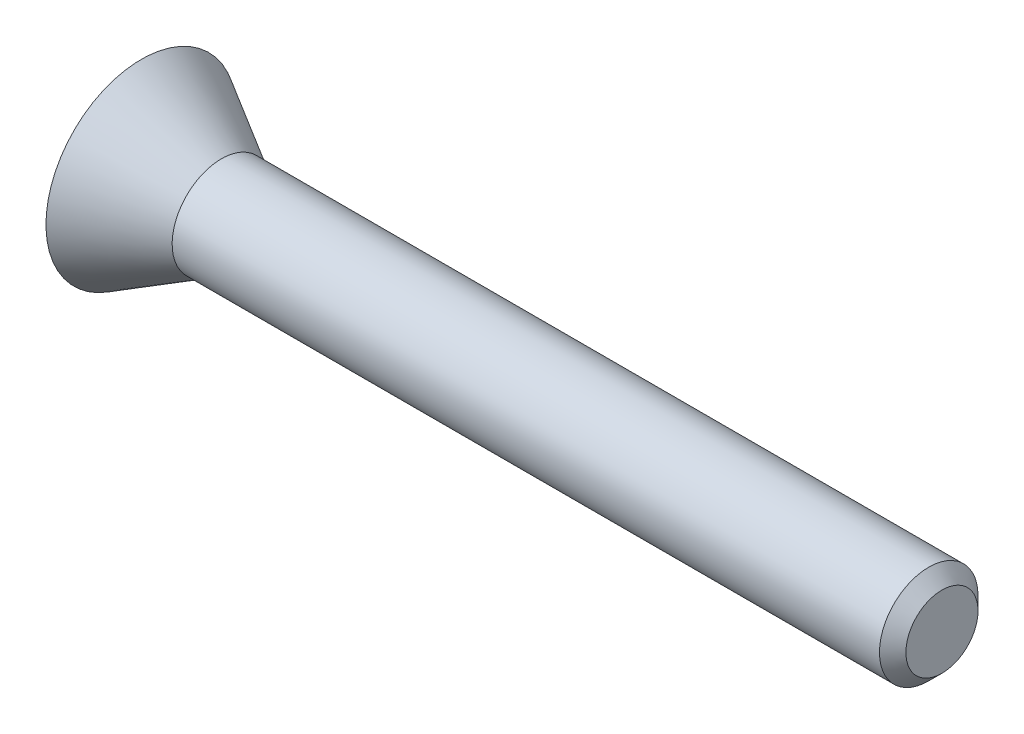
ISO-10303-21;
HEADER;
FILE_DESCRIPTION(('STEP AP214'),'2;1');
FILE_NAME('part.step','',(''),(''),'','','');
FILE_SCHEMA(('AUTOMOTIVE_DESIGN { 1 0 10303 214 1 1 1 1 }'));
ENDSEC;
DATA;
#1=APPLICATION_CONTEXT('core data for automotive mechanical design processes');
#2=APPLICATION_PROTOCOL_DEFINITION('international standard','automotive_design',2000,#1);
#3=PRODUCT_CONTEXT('',#1,'mechanical');
#4=PRODUCT('Part','Part','',(#3));
#5=PRODUCT_RELATED_PRODUCT_CATEGORY('part','',(#4));
#6=PRODUCT_DEFINITION_FORMATION('','',#4);
#7=PRODUCT_DEFINITION_CONTEXT('part definition',#1,'design');
#8=PRODUCT_DEFINITION('design','',#6,#7);
#9=PRODUCT_DEFINITION_SHAPE('','',#8);
#10=(LENGTH_UNIT() NAMED_UNIT(*) SI_UNIT(.MILLI.,.METRE.));
#11=(NAMED_UNIT(*) PLANE_ANGLE_UNIT() SI_UNIT($,.RADIAN.));
#12=(NAMED_UNIT(*) SI_UNIT($,.STERADIAN.) SOLID_ANGLE_UNIT());
#13=UNCERTAINTY_MEASURE_WITH_UNIT(LENGTH_MEASURE(1.E-05),#10,'distance_accuracy_value','');
#14=(GEOMETRIC_REPRESENTATION_CONTEXT(3) GLOBAL_UNCERTAINTY_ASSIGNED_CONTEXT((#13)) GLOBAL_UNIT_ASSIGNED_CONTEXT((#10,
#11,#12)) REPRESENTATION_CONTEXT('',''));
#15=CARTESIAN_POINT('',(0.,0.,0.));
#16=DIRECTION('',(0.,0.,1.));
#17=DIRECTION('',(1.,0.,0.));
#18=AXIS2_PLACEMENT_3D('',#15,#16,#17);
#19=CARTESIAN_POINT('',(-6.5,0.,0.));
#20=DIRECTION('',(1.,0.,0.));
#21=DIRECTION('',(0.,0.,-1.));
#22=AXIS2_PLACEMENT_3D('',#19,#20,#21);
#23=PLANE('',#22);
#24=CARTESIAN_POINT('',(-6.5,-0.765584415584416,-0.669358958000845));
#25=CARTESIAN_POINT('',(-6.5,-0.765313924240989,-0.655873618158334));
#26=CARTESIAN_POINT('',(-6.5,-0.764787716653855,-0.629639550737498));
#27=CARTESIAN_POINT('',(-6.5,-0.760424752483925,-0.591476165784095));
#28=CARTESIAN_POINT('',(-6.5,-0.75284651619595,-0.55570326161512));
#29=CARTESIAN_POINT('',(-6.5,-0.742388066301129,-0.52216377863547));
#30=CARTESIAN_POINT('',(-6.5,-0.729019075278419,-0.490856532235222));
#31=CARTESIAN_POINT('',(-6.5,-0.712628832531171,-0.461920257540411));
#32=CARTESIAN_POINT('',(-6.5,-0.693205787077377,-0.435340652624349));
#33=CARTESIAN_POINT('',(-6.5,-0.670791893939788,-0.411252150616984));
#34=CARTESIAN_POINT('',(-6.5,-0.645666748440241,-0.389824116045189));
#35=CARTESIAN_POINT('',(-6.5,-0.618075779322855,-0.371107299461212));
#36=CARTESIAN_POINT('',(-6.5,-0.588027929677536,-0.355259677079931));
#37=CARTESIAN_POINT('',(-6.5,-0.555507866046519,-0.342406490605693));
#38=CARTESIAN_POINT('',(-6.5,-0.520615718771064,-0.332325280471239));
#39=CARTESIAN_POINT('',(-6.5,-0.483327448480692,-0.325506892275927));
#40=CARTESIAN_POINT('',(-6.5,-0.443620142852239,-0.320914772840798));
#41=CARTESIAN_POINT('',(-6.5,-0.41632876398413,-0.320423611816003));
#42=CARTESIAN_POINT('',(-6.5,-0.402272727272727,-0.320170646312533));
#43=B_SPLINE_CURVE_WITH_KNOTS('',3,(#24,#25,#26,#27,#28,#29,#30,#31,#32,#33,#34,#35,#36,#37,#38,
#39,#40,#41,#42),.UNSPECIFIED.,.F.,.F.,(4,1,1,1,1,1,1,1,1,1,1,1,1,1,1,1,4),(0.,
0.070603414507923,0.137350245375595,0.20079014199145,0.261822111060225,0.321037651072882,
0.37871381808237,0.435588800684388,0.493032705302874,0.550614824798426,0.60814515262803,
0.667276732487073,0.728130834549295,0.790952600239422,0.85714223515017,0.926423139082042,1.),.UNSPECIFIED.);
#44=CARTESIAN_POINT('',(-6.5,-0.765584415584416,-0.669358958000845));
#45=VERTEX_POINT('',#44);
#46=CARTESIAN_POINT('',(-6.5,-0.402272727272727,-0.320170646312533));
#47=VERTEX_POINT('',#46);
#48=EDGE_CURVE('E381',#45,#47,#43,.T.);
#49=ORIENTED_EDGE('',*,*,#48,.F.);
#50=CARTESIAN_POINT('',(-6.5,-0.395698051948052,-1.01952129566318));
#51=CARTESIAN_POINT('',(-6.5,-0.409915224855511,-1.01925939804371));
#52=CARTESIAN_POINT('',(-6.5,-0.437689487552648,-1.01874776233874));
#53=CARTESIAN_POINT('',(-6.5,-0.478055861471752,-1.014234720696));
#54=CARTESIAN_POINT('',(-6.5,-0.51605184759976,-1.0073197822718));
#55=CARTESIAN_POINT('',(-6.5,-0.551537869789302,-0.997336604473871));
#56=CARTESIAN_POINT('',(-6.5,-0.584602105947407,-0.98442288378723));
#57=CARTESIAN_POINT('',(-6.5,-0.615255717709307,-0.968558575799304));
#58=CARTESIAN_POINT('',(-6.5,-0.643347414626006,-0.949670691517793));
#59=CARTESIAN_POINT('',(-6.5,-0.66908087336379,-0.928296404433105));
#60=CARTESIAN_POINT('',(-6.5,-0.691725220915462,-0.904038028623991));
#61=CARTESIAN_POINT('',(-6.5,-0.711622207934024,-0.877546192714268));
#62=CARTESIAN_POINT('',(-6.5,-0.728622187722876,-0.848727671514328));
#63=CARTESIAN_POINT('',(-6.5,-0.741846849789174,-0.817155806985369));
#64=CARTESIAN_POINT('',(-6.5,-0.752702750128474,-0.783552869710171));
#65=CARTESIAN_POINT('',(-6.5,-0.760076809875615,-0.747456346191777));
#66=CARTESIAN_POINT('',(-6.5,-0.764870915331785,-0.709180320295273));
#67=CARTESIAN_POINT('',(-6.5,-0.765342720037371,-0.682848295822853));
#68=CARTESIAN_POINT('',(-6.5,-0.765584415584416,-0.669358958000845));
#69=B_SPLINE_CURVE_WITH_KNOTS('',3,(#50,#51,#52,#53,#54,#55,#56,#57,#58,#59,#60,#61,#62,#63,#64,
#65,#66,#67,#68),.UNSPECIFIED.,.F.,.F.,(4,1,1,1,1,1,1,1,1,1,1,1,1,1,1,1,4),(0.,
0.0736363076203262,0.143853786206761,0.210167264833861,0.273535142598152,0.334525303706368,
0.393774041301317,0.451974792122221,0.509587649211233,0.566708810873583,0.623480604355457,
0.680964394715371,0.739551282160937,0.800463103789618,0.863640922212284,0.930146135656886,1.),.UNSPECIFIED.);
#70=CARTESIAN_POINT('',(-6.5,-0.395698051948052,-1.01952129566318));
#71=VERTEX_POINT('',#70);
#72=EDGE_CURVE('E54',#71,#45,#69,.T.);
#73=ORIENTED_EDGE('',*,*,#72,.F.);
#74=DIRECTION('',(0.,-1.,0.));
#75=VECTOR('',#74,1.);
#76=CARTESIAN_POINT('',(-6.5,-0.394724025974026,-1.01952129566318));
#77=LINE('',#76,#75);
#78=CARTESIAN_POINT('',(-6.5,-0.394724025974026,-1.01952129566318));
#79=VERTEX_POINT('',#78);
#80=EDGE_CURVE('E425',#79,#71,#77,.T.);
#81=ORIENTED_EDGE('',*,*,#80,.F.);
#82=CARTESIAN_POINT('',(-6.5,-0.0331168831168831,-0.708076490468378));
#83=CARTESIAN_POINT('',(-6.5,-0.0333895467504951,-0.720101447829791));
#84=CARTESIAN_POINT('',(-6.5,-0.0339202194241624,-0.743505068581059));
#85=CARTESIAN_POINT('',(-6.5,-0.0382619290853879,-0.777559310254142));
#86=CARTESIAN_POINT('',(-6.5,-0.0459559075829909,-0.809385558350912));
#87=CARTESIAN_POINT('',(-6.5,-0.0560558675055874,-0.839384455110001));
#88=CARTESIAN_POINT('',(-6.5,-0.0695240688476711,-0.867241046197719));
#89=CARTESIAN_POINT('',(-6.5,-0.0860039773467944,-0.89302441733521));
#90=CARTESIAN_POINT('',(-6.5,-0.105298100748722,-0.916794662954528));
#91=CARTESIAN_POINT('',(-6.5,-0.127638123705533,-0.938238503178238));
#92=CARTESIAN_POINT('',(-6.5,-0.152454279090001,-0.957557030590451));
#93=CARTESIAN_POINT('',(-6.5,-0.179997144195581,-0.974112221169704));
#94=CARTESIAN_POINT('',(-6.5,-0.209806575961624,-0.988339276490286));
#95=CARTESIAN_POINT('',(-6.5,-0.24218065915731,-0.999673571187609));
#96=CARTESIAN_POINT('',(-6.5,-0.276856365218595,-1.00875750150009));
#97=CARTESIAN_POINT('',(-6.5,-0.314030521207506,-1.01489116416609));
#98=CARTESIAN_POINT('',(-6.5,-0.353562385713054,-1.01894758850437));
#99=CARTESIAN_POINT('',(-6.5,-0.380752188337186,-1.01932655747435));
#100=CARTESIAN_POINT('',(-6.5,-0.394724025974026,-1.01952129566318));
#101=B_SPLINE_CURVE_WITH_KNOTS('',3,(#82,#83,#84,#85,#86,#87,#88,#89,#90,#91,#92,#93,#94,#95,
#96,#97,#98,#99,#100),.UNSPECIFIED.,.F.,.F.,(4,1,1,1,1,1,1,1,1,1,1,1,1,1,1,1,4),(0.,
0.0665766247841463,0.129575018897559,0.189644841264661,0.24763903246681,0.30453064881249,
0.360514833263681,0.416743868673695,0.473642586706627,0.531631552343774,0.590524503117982,
0.65124161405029,0.714220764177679,0.780176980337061,0.849489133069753,0.922658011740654,1.),.UNSPECIFIED.);
#102=CARTESIAN_POINT('',(-6.5,-0.0331168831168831,-0.708076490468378));
#103=VERTEX_POINT('',#102);
#104=EDGE_CURVE('E417',#103,#79,#101,.T.);
#105=ORIENTED_EDGE('',*,*,#104,.F.);
#106=CARTESIAN_POINT('',(-6.5,-0.114935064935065,-0.555884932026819));
#107=CARTESIAN_POINT('',(-6.5,-0.108382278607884,-0.559573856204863));
#108=CARTESIAN_POINT('',(-6.5,-0.0955396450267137,-0.566803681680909));
#109=CARTESIAN_POINT('',(-6.5,-0.0789183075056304,-0.581045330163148));
#110=CARTESIAN_POINT('',(-6.5,-0.0644841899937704,-0.596928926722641));
#111=CARTESIAN_POINT('',(-6.5,-0.0530036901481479,-0.615298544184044));
#112=CARTESIAN_POINT('',(-6.5,-0.0439208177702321,-0.635609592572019));
#113=CARTESIAN_POINT('',(-6.5,-0.0377286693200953,-0.658028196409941));
#114=CARTESIAN_POINT('',(-6.5,-0.0336662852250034,-0.682360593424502));
#115=CARTESIAN_POINT('',(-6.5,-0.033304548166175,-0.699292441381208));
#116=CARTESIAN_POINT('',(-6.5,-0.0331168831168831,-0.708076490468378));
#117=B_SPLINE_CURVE_WITH_KNOTS('',3,(#106,#107,#108,#109,#110,#111,#112,#113,#114,#115,#116),
.UNSPECIFIED.,.F.,.F.,(4,1,1,1,1,1,1,1,4),(0.,0.123274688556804,0.241602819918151,
0.357777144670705,0.474683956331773,0.595870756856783,0.722082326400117,0.855819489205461,1.),.UNSPECIFIED.);
#118=CARTESIAN_POINT('',(-6.5,-0.0367677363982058,-0.664792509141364));
#119=VERTEX_POINT('',#118);
#120=EDGE_CURVE('E412',#119,#103,#117,.T.);
#121=ORIENTED_EDGE('',*,*,#120,.F.);
#122=DIRECTION('',(0.,-0.900247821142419,0.435377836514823));
#123=VECTOR('',#122,1.);
#124=CARTESIAN_POINT('',(-6.5,0.45,-0.900203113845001));
#125=LINE('',#124,#123);
#126=CARTESIAN_POINT('',(-6.5,0.45,-0.900203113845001));
#127=VERTEX_POINT('',#126);
#128=EDGE_CURVE('E409',#127,#119,#125,.T.);
#129=ORIENTED_EDGE('',*,*,#128,.F.);
#130=DIRECTION('',(0.,0.,-1.));
#131=VECTOR('',#130,1.);
#132=CARTESIAN_POINT('',(-6.5,0.45,-0.645495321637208));
#133=LINE('',#132,#131);
#134=CARTESIAN_POINT('',(-6.5,0.45,-0.645495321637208));
#135=VERTEX_POINT('',#134);
#136=EDGE_CURVE('E406',#135,#127,#133,.T.);
#137=ORIENTED_EDGE('',*,*,#136,.F.);
#138=DIRECTION('',(0.,0.905627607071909,-0.424073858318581));
#139=VECTOR('',#138,1.);
#140=CARTESIAN_POINT('',(-6.5,-0.0679383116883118,-0.402962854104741));
#141=LINE('',#140,#139);
#142=CARTESIAN_POINT('',(-6.5,-0.0679383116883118,-0.402962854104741));
#143=VERTEX_POINT('',#142);
#144=EDGE_CURVE('E400',#143,#135,#141,.T.);
#145=ORIENTED_EDGE('',*,*,#144,.F.);
#146=CARTESIAN_POINT('',(-6.5,-0.401542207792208,-0.320170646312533));
#147=CARTESIAN_POINT('',(-6.5,-0.388382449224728,-0.320477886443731));
#148=CARTESIAN_POINT('',(-6.5,-0.361596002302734,-0.32110326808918));
#149=CARTESIAN_POINT('',(-6.5,-0.320940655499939,-0.325464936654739));
#150=CARTESIAN_POINT('',(-6.50000000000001,-0.279197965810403,-0.332204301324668));
#151=CARTESIAN_POINT('',(-6.5,-0.236741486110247,-0.342089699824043));
#152=CARTESIAN_POINT('',(-6.5,-0.194005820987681,-0.354143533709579));
#153=CARTESIAN_POINT('',(-6.5,-0.151483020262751,-0.368422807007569));
#154=CARTESIAN_POINT('',(-6.5,-0.109273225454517,-0.38430064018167));
#155=CARTESIAN_POINT('',(-6.5,-0.0817551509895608,-0.396724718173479));
#156=CARTESIAN_POINT('',(-6.5,-0.0679383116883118,-0.402962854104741));
#157=B_SPLINE_CURVE_WITH_KNOTS('',3,(#146,#147,#148,#149,#150,#151,#152,#153,#154,#155,#156),
.UNSPECIFIED.,.F.,.F.,(4,1,1,1,1,1,1,1,4),(0.,0.114002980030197,0.232050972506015,
0.353906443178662,0.480147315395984,0.609491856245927,0.738474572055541,0.868687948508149,1.),.UNSPECIFIED.);
#158=CARTESIAN_POINT('',(-6.5,-0.401542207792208,-0.320170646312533));
#159=VERTEX_POINT('',#158);
#160=EDGE_CURVE('E395',#159,#143,#157,.T.);
#161=ORIENTED_EDGE('',*,*,#160,.F.);
#162=DIRECTION('',(0.,1.,0.));
#163=VECTOR('',#162,1.);
#164=CARTESIAN_POINT('',(-6.5,-0.402272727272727,-0.320170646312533));
#165=LINE('',#164,#163);
#166=EDGE_CURVE('E389',#47,#159,#165,.T.);
#167=ORIENTED_EDGE('',*,*,#166,.F.);
#168=EDGE_LOOP('',(#49,#73,#81,#105,#121,#129,#137,#145,#161,#167));
#169=FACE_BOUND('',#168,.T.);
#170=CARTESIAN_POINT('',(-6.5,0.,0.));
#171=DIRECTION('',(-1.,0.,0.));
#172=DIRECTION('',(0.,-1.,0.));
#173=AXIS2_PLACEMENT_3D('',#170,#171,#172);
#174=CIRCLE('',#173,1.55);
#175=CARTESIAN_POINT('',(-6.5,-1.55000000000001,0.));
#176=VERTEX_POINT('',#175);
#177=EDGE_CURVE('E557',#176,#176,#174,.T.);
#178=ORIENTED_EDGE('',*,*,#177,.T.);
#179=EDGE_LOOP('',(#178));
#180=FACE_BOUND('',#179,.T.);
#181=DIRECTION('',(0.,1.,0.));
#182=VECTOR('',#181,1.);
#183=CARTESIAN_POINT('',(-6.5,0.68,0.155));
#184=LINE('',#183,#182);
#185=CARTESIAN_POINT('',(-6.5,-1.025,0.155));
#186=VERTEX_POINT('',#185);
#187=CARTESIAN_POINT('',(-6.5,0.68,0.155));
#188=VERTEX_POINT('',#187);
#189=EDGE_CURVE('E563',#186,#188,#184,.T.);
#190=ORIENTED_EDGE('',*,*,#189,.F.);
#191=CARTESIAN_POINT('',(-6.5,-1.025,0.));
#192=DIRECTION('',(-1.,0.,0.));
#193=DIRECTION('',(0.,0.,1.));
#194=AXIS2_PLACEMENT_3D('',#191,#192,#193);
#195=CIRCLE('',#194,0.155);
#196=CARTESIAN_POINT('',(-6.5,-1.025,-0.155));
#197=VERTEX_POINT('',#196);
#198=EDGE_CURVE('E652',#197,#186,#195,.T.);
#199=ORIENTED_EDGE('',*,*,#198,.F.);
#200=DIRECTION('',(0.,-1.,0.));
#201=VECTOR('',#200,1.);
#202=CARTESIAN_POINT('',(-6.5,0.68,-0.155));
#203=LINE('',#202,#201);
#204=CARTESIAN_POINT('',(-6.5,0.68,-0.155));
#205=VERTEX_POINT('',#204);
#206=EDGE_CURVE('E690',#205,#197,#203,.T.);
#207=ORIENTED_EDGE('',*,*,#206,.F.);
#208=DIRECTION('',(0.,0.,1.));
#209=VECTOR('',#208,1.);
#210=CARTESIAN_POINT('',(-6.5,0.68,-0.37));
#211=LINE('',#210,#209);
#212=CARTESIAN_POINT('',(-6.5,0.68,-0.37));
#213=VERTEX_POINT('',#212);
#214=EDGE_CURVE('E720',#213,#205,#211,.T.);
#215=ORIENTED_EDGE('',*,*,#214,.F.);
#216=DIRECTION('',(0.,-0.858712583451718,-0.512457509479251));
#217=VECTOR('',#216,1.);
#218=CARTESIAN_POINT('',(-6.5,1.3,0.));
#219=LINE('',#218,#217);
#220=CARTESIAN_POINT('',(-6.5,1.3,0.));
#221=VERTEX_POINT('',#220);
#222=EDGE_CURVE('E717',#221,#213,#219,.T.);
#223=ORIENTED_EDGE('',*,*,#222,.F.);
#224=DIRECTION('',(0.,0.858712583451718,-0.512457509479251));
#225=VECTOR('',#224,1.);
#226=CARTESIAN_POINT('',(-6.5,1.3,0.));
#227=LINE('',#226,#225);
#228=CARTESIAN_POINT('',(-6.5,0.68,0.37));
#229=VERTEX_POINT('',#228);
#230=EDGE_CURVE('E714',#229,#221,#227,.T.);
#231=ORIENTED_EDGE('',*,*,#230,.F.);
#232=DIRECTION('',(0.,0.,1.));
#233=VECTOR('',#232,1.);
#234=CARTESIAN_POINT('',(-6.5,0.68,0.37));
#235=LINE('',#234,#233);
#236=EDGE_CURVE('E711',#188,#229,#235,.T.);
#237=ORIENTED_EDGE('',*,*,#236,.F.);
#238=EDGE_LOOP('',(#190,#199,#207,#215,#223,#231,#237));
#239=FACE_BOUND('',#238,.T.);
#240=DIRECTION('',(0.,1.,0.));
#241=VECTOR('',#240,1.);
#242=CARTESIAN_POINT('',(-6.5,-0.75,1.02208584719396));
#243=LINE('',#242,#241);
#244=CARTESIAN_POINT('',(-6.5,-0.75,1.02208584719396));
#245=VERTEX_POINT('',#244);
#246=CARTESIAN_POINT('',(-6.5,-0.545941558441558,1.02208584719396));
#247=VERTEX_POINT('',#246);
#248=EDGE_CURVE('E568',#245,#247,#243,.T.);
#249=ORIENTED_EDGE('',*,*,#248,.F.);
#250=DIRECTION('',(0.,0.,1.));
#251=VECTOR('',#250,1.);
#252=CARTESIAN_POINT('',(-6.5,-0.75,0.315430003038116));
#253=LINE('',#252,#251);
#254=CARTESIAN_POINT('',(-6.5,-0.75,0.315430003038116));
#255=VERTEX_POINT('',#254);
#256=EDGE_CURVE('E434',#255,#245,#253,.T.);
#257=ORIENTED_EDGE('',*,*,#256,.F.);
#258=DIRECTION('',(0.,-1.,0.));
#259=VECTOR('',#258,1.);
#260=CARTESIAN_POINT('',(-6.5,-0.531818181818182,0.315430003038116));
#261=LINE('',#260,#259);
#262=CARTESIAN_POINT('',(-6.5,-0.531818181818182,0.315430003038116));
#263=VERTEX_POINT('',#262);
#264=EDGE_CURVE('E456',#263,#255,#261,.T.);
#265=ORIENTED_EDGE('',*,*,#264,.F.);
#266=DIRECTION('',(0.,0.,-1.));
#267=VECTOR('',#266,1.);
#268=CARTESIAN_POINT('',(-6.5,-0.531818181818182,0.723790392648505));
#269=LINE('',#268,#267);
#270=CARTESIAN_POINT('',(-6.5,-0.531818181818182,0.723790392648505));
#271=VERTEX_POINT('',#270);
#272=EDGE_CURVE('E645',#271,#263,#269,.T.);
#273=ORIENTED_EDGE('',*,*,#272,.F.);
#274=DIRECTION('',(0.,-0.786034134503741,0.618183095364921));
#275=VECTOR('',#274,1.);
#276=CARTESIAN_POINT('',(-6.5,-0.157792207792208,0.429634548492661));
#277=LINE('',#276,#275);
#278=CARTESIAN_POINT('',(-6.5,-0.157792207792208,0.429634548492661));
#279=VERTEX_POINT('',#278);
#280=EDGE_CURVE('E639',#279,#271,#277,.T.);
#281=ORIENTED_EDGE('',*,*,#280,.F.);
#282=CARTESIAN_POINT('',(-6.5,0.150974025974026,0.322004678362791));
#283=CARTESIAN_POINT('',(-6.5,0.137320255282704,0.322315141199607));
#284=CARTESIAN_POINT('',(-6.5,0.10998858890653,0.322936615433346));
#285=CARTESIAN_POINT('',(-6.5,0.069082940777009,0.328546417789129));
#286=CARTESIAN_POINT('',(-6.5,0.0283861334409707,0.337586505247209));
#287=CARTESIAN_POINT('',(-6.5,-0.0119052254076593,0.350001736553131));
#288=CARTESIAN_POINT('',(-6.5,-0.0510932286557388,0.365424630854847));
#289=CARTESIAN_POINT('',(-6.5,-0.0886411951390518,0.383935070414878));
#290=CARTESIAN_POINT('',(-6.5,-0.124565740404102,0.404826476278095));
#291=CARTESIAN_POINT('',(-6.5,-0.146737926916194,0.421381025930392));
#292=CARTESIAN_POINT('',(-6.5,-0.157792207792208,0.429634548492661));
#293=B_SPLINE_CURVE_WITH_KNOTS('',3,(#282,#283,#284,#285,#286,#287,#288,#289,#290,#291,#292),
.UNSPECIFIED.,.F.,.F.,(4,1,1,1,1,1,1,1,4),(0.,0.123046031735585,0.246309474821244,
0.371480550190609,0.498560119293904,0.626024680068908,0.750715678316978,0.875715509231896,1.),.UNSPECIFIED.);
#294=CARTESIAN_POINT('',(-6.5,0.150974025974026,0.322004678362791));
#295=VERTEX_POINT('',#294);
#296=EDGE_CURVE('E634',#295,#279,#293,.T.);
#297=ORIENTED_EDGE('',*,*,#296,.F.);
#298=DIRECTION('',(0.,-1.,0.));
#299=VECTOR('',#298,1.);
#300=CARTESIAN_POINT('',(-6.5,0.151948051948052,0.322004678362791));
#301=LINE('',#300,#299);
#302=CARTESIAN_POINT('',(-6.5,0.151948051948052,0.322004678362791));
#303=VERTEX_POINT('',#302);
#304=EDGE_CURVE('E628',#303,#295,#301,.T.);
#305=ORIENTED_EDGE('',*,*,#304,.F.);
#306=CARTESIAN_POINT('',(-6.5,0.465584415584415,0.675332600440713));
#307=CARTESIAN_POINT('',(-6.5,0.465390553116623,0.661685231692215));
#308=CARTESIAN_POINT('',(-6.5,0.465013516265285,0.635142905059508));
#309=CARTESIAN_POINT('',(-6.5,0.460943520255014,0.596501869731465));
#310=CARTESIAN_POINT('',(-6.5,0.454800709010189,0.560144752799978));
#311=CARTESIAN_POINT('',(-6.5,0.445814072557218,0.526130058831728));
#312=CARTESIAN_POINT('',(-6.5,0.434091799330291,0.494594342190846));
#313=CARTESIAN_POINT('',(-6.5,0.419957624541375,0.465443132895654));
#314=CARTESIAN_POINT('',(-6.5,0.403291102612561,0.43861549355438));
#315=CARTESIAN_POINT('',(-6.5,0.38405660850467,0.414316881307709));
#316=CARTESIAN_POINT('',(-6.5,0.362603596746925,0.392454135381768));
#317=CARTESIAN_POINT('',(-6.5,0.338714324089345,0.373636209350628));
#318=CARTESIAN_POINT('',(-6.5,0.312871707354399,0.35734617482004));
#319=CARTESIAN_POINT('',(-6.5,0.2845745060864,0.344612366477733));
#320=CARTESIAN_POINT('',(-6.5,0.254488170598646,0.334128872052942));
#321=CARTESIAN_POINT('',(-6.5,0.222073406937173,0.327340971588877));
#322=CARTESIAN_POINT('',(-6.5,0.187711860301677,0.322766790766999));
#323=CARTESIAN_POINT('',(-6.5,0.164058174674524,0.322262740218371));
#324=CARTESIAN_POINT('',(-6.5,0.151948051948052,0.322004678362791));
#325=B_SPLINE_CURVE_WITH_KNOTS('',3,(#306,#307,#308,#309,#310,#311,#312,#313,#314,#315,#316,
#317,#318,#319,#320,#321,#322,#323,#324),.UNSPECIFIED.,.F.,.F.,(4,1,1,1,1,1,1,1,1,1,1,1,1,1,1,1,
4),(0.,0.0762312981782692,0.148259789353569,0.216860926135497,0.28210063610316,
0.344528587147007,0.404571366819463,0.462840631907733,0.520642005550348,0.577409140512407,
0.633580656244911,0.690215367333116,0.747647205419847,0.806597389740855,0.867894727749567,
0.932365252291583,1.),.UNSPECIFIED.);
#326=CARTESIAN_POINT('',(-6.5,0.465584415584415,0.675332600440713));
#327=VERTEX_POINT('',#326);
#328=EDGE_CURVE('E620',#327,#303,#325,.T.);
#329=ORIENTED_EDGE('',*,*,#328,.F.);
#330=CARTESIAN_POINT('',(-6.5,0.105438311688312,1.03693974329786));
#331=CARTESIAN_POINT('',(-6.5,0.11934799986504,1.03580067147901));
#332=CARTESIAN_POINT('',(-6.5,0.146499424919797,1.03357722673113));
#333=CARTESIAN_POINT('',(-6.5,0.185775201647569,1.02628780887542));
#334=CARTESIAN_POINT('',(-6.5,0.22277029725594,1.0168665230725));
#335=CARTESIAN_POINT('',(-6.5,0.257477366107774,1.00488137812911));
#336=CARTESIAN_POINT('',(-6.5,0.289494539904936,0.989480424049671));
#337=CARTESIAN_POINT('',(-6.5,0.3194911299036,0.972176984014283));
#338=CARTESIAN_POINT('',(-6.5,0.346539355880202,0.95136528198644));
#339=CARTESIAN_POINT('',(-6.5,0.371544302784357,0.928583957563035));
#340=CARTESIAN_POINT('',(-6.5,0.393568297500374,0.903209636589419));
#341=CARTESIAN_POINT('',(-6.5,0.412996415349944,0.876153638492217));
#342=CARTESIAN_POINT('',(-6.5,0.429163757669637,0.847006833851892));
#343=CARTESIAN_POINT('',(-6.5,0.442575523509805,0.81621233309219));
#344=CARTESIAN_POINT('',(-6.5,0.452754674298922,0.78342871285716));
#345=CARTESIAN_POINT('',(-6.5,0.460379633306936,0.749084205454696));
#346=CARTESIAN_POINT('',(-6.5,0.464776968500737,0.71278460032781));
#347=CARTESIAN_POINT('',(-6.5,0.465311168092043,0.688006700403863));
#348=CARTESIAN_POINT('',(-6.5,0.465584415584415,0.675332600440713));
#349=B_SPLINE_CURVE_WITH_KNOTS('',3,(#330,#331,#332,#333,#334,#335,#336,#337,#338,#339,#340,
#341,#342,#343,#344,#345,#346,#347,#348),.UNSPECIFIED.,.F.,.F.,(4,1,1,1,1,1,1,1,1,1,1,1,1,1,1,1,
4),(0.,0.0733268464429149,0.14313249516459,0.209679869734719,0.273918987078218,0.33576228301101,
0.396210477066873,0.45560885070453,0.514796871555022,0.573764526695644,0.631900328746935,
0.689592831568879,0.748648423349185,0.808163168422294,0.86976604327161,0.933384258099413,1.),.UNSPECIFIED.);
#350=CARTESIAN_POINT('',(-6.5,0.105438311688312,1.03693974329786));
#351=VERTEX_POINT('',#350);
#352=EDGE_CURVE('E615',#351,#327,#349,.T.);
#353=ORIENTED_EDGE('',*,*,#352,.F.);
#354=DIRECTION('',(0.,1.,0.));
#355=VECTOR('',#354,1.);
#356=CARTESIAN_POINT('',(-6.5,0.104707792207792,1.03693974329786));
#357=LINE('',#356,#355);
#358=CARTESIAN_POINT('',(-6.5,0.104707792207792,1.03693974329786));
#359=VERTEX_POINT('',#358);
#360=EDGE_CURVE('E612',#359,#351,#357,.T.);
#361=ORIENTED_EDGE('',*,*,#360,.F.);
#362=DIRECTION('',(0.,0.,1.));
#363=VECTOR('',#362,1.);
#364=CARTESIAN_POINT('',(-6.5,0.104707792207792,0.8060955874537));
#365=LINE('',#364,#363);
#366=CARTESIAN_POINT('',(-6.5,0.104707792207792,0.8060955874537));
#367=VERTEX_POINT('',#366);
#368=EDGE_CURVE('E609',#367,#359,#365,.T.);
#369=ORIENTED_EDGE('',*,*,#368,.F.);
#370=DIRECTION('',(0.,-1.,0.));
#371=VECTOR('',#370,1.);
#372=CARTESIAN_POINT('',(-6.5,0.105438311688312,0.8060955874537));
#373=LINE('',#372,#371);
#374=CARTESIAN_POINT('',(-6.5,0.105438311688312,0.8060955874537));
#375=VERTEX_POINT('',#374);
#376=EDGE_CURVE('E603',#375,#367,#373,.T.);
#377=ORIENTED_EDGE('',*,*,#376,.F.);
#378=CARTESIAN_POINT('',(-6.5,0.247402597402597,0.673628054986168));
#379=CARTESIAN_POINT('',(-6.5,0.247058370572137,0.682449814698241));
#380=CARTESIAN_POINT('',(-6.5,0.246389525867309,0.699590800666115));
#381=CARTESIAN_POINT('',(-6.5,0.238976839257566,0.723856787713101));
#382=CARTESIAN_POINT('',(-6.5,0.227349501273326,0.745722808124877));
#383=CARTESIAN_POINT('',(-6.5,0.210758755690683,0.764573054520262));
#384=CARTESIAN_POINT('',(-6.5,0.189928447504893,0.78018248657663));
#385=CARTESIAN_POINT('',(-6.5,0.165399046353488,0.792851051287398));
#386=CARTESIAN_POINT('',(-6.5,0.136727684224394,0.801455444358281));
#387=CARTESIAN_POINT('',(-6.5,0.116203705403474,0.804499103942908));
#388=CARTESIAN_POINT('',(-6.5,0.105438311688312,0.8060955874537));
#389=B_SPLINE_CURVE_WITH_KNOTS('',3,(#378,#379,#380,#381,#382,#383,#384,#385,#386,#387,#388),
.UNSPECIFIED.,.F.,.F.,(4,1,1,1,1,1,1,1,4),(0.,0.122603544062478,0.238222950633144,
0.350089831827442,0.465559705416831,0.58502806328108,0.711014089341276,0.848418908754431,1.),.UNSPECIFIED.);
#390=CARTESIAN_POINT('',(-6.5,0.247402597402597,0.673628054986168));
#391=VERTEX_POINT('',#390);
#392=EDGE_CURVE('E595',#391,#375,#389,.T.);
#393=ORIENTED_EDGE('',*,*,#392,.F.);
#394=CARTESIAN_POINT('',(-6.5,0.145616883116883,0.553822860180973));
#395=CARTESIAN_POINT('',(-6.5,0.153289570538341,0.554155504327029));
#396=CARTESIAN_POINT('',(-6.5,0.16798921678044,0.55479279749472));
#397=CARTESIAN_POINT('',(-6.5,0.188701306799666,0.560797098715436));
#398=CARTESIAN_POINT('',(-6.5,0.206738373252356,0.570637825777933));
#399=CARTESIAN_POINT('',(-6.5,0.221636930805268,0.584732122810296));
#400=CARTESIAN_POINT('',(-6.5,0.233420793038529,0.602278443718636));
#401=CARTESIAN_POINT('',(-6.5,0.241725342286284,0.623273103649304));
#402=CARTESIAN_POINT('',(-6.5,0.246487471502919,0.647441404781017));
#403=CARTESIAN_POINT('',(-6.5,0.247086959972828,0.664595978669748));
#404=CARTESIAN_POINT('',(-6.5,0.247402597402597,0.673628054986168));
#405=B_SPLINE_CURVE_WITH_KNOTS('',3,(#394,#395,#396,#397,#398,#399,#400,#401,#402,#403,#404),
.UNSPECIFIED.,.F.,.F.,(4,1,1,1,1,1,1,1,4),(0.,0.128749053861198,0.246662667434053,
0.359069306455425,0.47107757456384,0.588039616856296,0.711712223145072,0.848213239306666,1.),.UNSPECIFIED.);
#406=CARTESIAN_POINT('',(-6.5,0.145616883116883,0.553822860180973));
#407=VERTEX_POINT('',#406);
#408=EDGE_CURVE('E590',#407,#391,#405,.T.);
#409=ORIENTED_EDGE('',*,*,#408,.F.);
#410=DIRECTION('',(0.,1.,0.));
#411=VECTOR('',#410,1.);
#412=CARTESIAN_POINT('',(-6.5,0.143912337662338,0.553822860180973));
#413=LINE('',#412,#411);
#414=CARTESIAN_POINT('',(-6.5,0.143912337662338,0.553822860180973));
#415=VERTEX_POINT('',#414);
#416=EDGE_CURVE('E584',#415,#407,#413,.T.);
#417=ORIENTED_EDGE('',*,*,#416,.F.);
#418=CARTESIAN_POINT('',(-6.5,-0.00267857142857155,0.612020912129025));
#419=CARTESIAN_POINT('',(-6.5,0.00942362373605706,0.603432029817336));
#420=CARTESIAN_POINT('',(-6.5,0.0330043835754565,0.586696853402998));
#421=CARTESIAN_POINT('',(-6.5,0.0653877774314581,0.571550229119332));
#422=CARTESIAN_POINT('',(-6.5,0.0907767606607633,0.562114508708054));
#423=CARTESIAN_POINT('',(-6.5,0.109188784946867,0.557617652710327));
#424=CARTESIAN_POINT('',(-6.5,0.126755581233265,0.554409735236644));
#425=CARTESIAN_POINT('',(-6.5,0.138298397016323,0.55401489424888));
#426=CARTESIAN_POINT('',(-6.5,0.143912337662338,0.553822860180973));
#427=B_SPLINE_CURVE_WITH_KNOTS('',3,(#418,#419,#420,#421,#422,#423,#424,#425,#426),
.UNSPECIFIED.,.F.,.F.,(4,1,1,1,1,1,4),(0.,0.27737542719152,0.540457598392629,0.666416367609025,
0.784009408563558,0.894951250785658,1.),.UNSPECIFIED.);
#428=CARTESIAN_POINT('',(-6.5,-0.00267857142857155,0.612020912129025));
#429=VERTEX_POINT('',#428);
#430=EDGE_CURVE('E575',#429,#415,#427,.T.);
#431=ORIENTED_EDGE('',*,*,#430,.F.);
#432=DIRECTION('',(0.,0.798150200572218,-0.602458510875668));
#433=VECTOR('',#432,1.);
#434=CARTESIAN_POINT('',(-6.5,-0.545941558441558,1.02208584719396));
#435=LINE('',#434,#433);
#436=EDGE_CURVE('E572',#247,#429,#435,.T.);
#437=ORIENTED_EDGE('',*,*,#436,.F.);
#438=EDGE_LOOP('',(#249,#257,#265,#273,#281,#297,#305,#329,#353,#361,#369,#377,#393,#409,#417,
#431,#437));
#439=FACE_BOUND('',#438,.T.);
#440=ADVANCED_FACE('F39',(#169,#180,#239,#439),#23,.F.);
#441=CARTESIAN_POINT('',(-6.5,0.,0.));
#442=DIRECTION('',(-1.,0.,0.));
#443=DIRECTION('',(0.,-1.,0.));
#444=AXIS2_PLACEMENT_3D('',#441,#442,#443);
#445=CONICAL_SURFACE('',#444,1.55,0.523598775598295);
#446=CARTESIAN_POINT('',(-5.20096189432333,0.,0.));
#447=DIRECTION('',(-1.,0.,0.));
#448=DIRECTION('',(0.,-1.,0.));
#449=AXIS2_PLACEMENT_3D('',#446,#447,#448);
#450=CIRCLE('',#449,0.800000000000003);
#451=CARTESIAN_POINT('',(-5.20096189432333,-0.800000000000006,0.));
#452=VERTEX_POINT('',#451);
#453=EDGE_CURVE('E727',#452,#452,#450,.T.);
#454=ORIENTED_EDGE('',*,*,#453,.T.);
#455=EDGE_LOOP('',(#454));
#456=FACE_BOUND('',#455,.T.);
#457=ORIENTED_EDGE('',*,*,#177,.F.);
#458=EDGE_LOOP('',(#457));
#459=FACE_BOUND('',#458,.T.);
#460=ADVANCED_FACE('F530',(#456,#459),#445,.T.);
#461=CARTESIAN_POINT('',(-6.5,0.,0.));
#462=DIRECTION('',(-1.,0.,0.));
#463=DIRECTION('',(0.,-1.,0.));
#464=AXIS2_PLACEMENT_3D('',#461,#462,#463);
#465=CYLINDRICAL_SURFACE('',#464,0.800000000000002);
#466=CARTESIAN_POINT('',(6.2855,0.,0.));
#467=DIRECTION('',(1.,0.,0.));
#468=DIRECTION('',(0.,1.,0.));
#469=AXIS2_PLACEMENT_3D('',#466,#467,#468);
#470=CIRCLE('',#469,0.800000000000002);
#471=CARTESIAN_POINT('',(6.2855,0.800000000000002,0.));
#472=VERTEX_POINT('',#471);
#473=EDGE_CURVE('E47',#472,#472,#470,.F.);
#474=ORIENTED_EDGE('',*,*,#473,.T.);
#475=EDGE_LOOP('',(#474));
#476=FACE_BOUND('',#475,.T.);
#477=ORIENTED_EDGE('',*,*,#453,.F.);
#478=EDGE_LOOP('',(#477));
#479=FACE_BOUND('',#478,.T.);
#480=ADVANCED_FACE('F527',(#476,#479),#465,.T.);
#481=CARTESIAN_POINT('',(6.5,0.,0.));
#482=DIRECTION('',(1.,0.,0.));
#483=DIRECTION('',(0.,0.,-1.));
#484=AXIS2_PLACEMENT_3D('',#481,#482,#483);
#485=PLANE('',#484);
#486=CARTESIAN_POINT('',(6.5,0.,0.));
#487=DIRECTION('',(1.,0.,0.));
#488=DIRECTION('',(0.,0.,-1.));
#489=AXIS2_PLACEMENT_3D('',#486,#487,#488);
#490=CIRCLE('',#489,0.585500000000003);
#491=CARTESIAN_POINT('',(6.5,0.,-0.585500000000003));
#492=VERTEX_POINT('',#491);
#493=EDGE_CURVE('E11',#492,#492,#490,.T.);
#494=ORIENTED_EDGE('',*,*,#493,.T.);
#495=EDGE_LOOP('',(#494));
#496=FACE_BOUND('',#495,.T.);
#497=ADVANCED_FACE('F525',(#496),#485,.T.);
#498=CARTESIAN_POINT('',(-6.1,-1.025,0.));
#499=DIRECTION('',(-1.,0.,0.));
#500=DIRECTION('',(0.,0.,1.));
#501=AXIS2_PLACEMENT_3D('',#498,#499,#500);
#502=CYLINDRICAL_SURFACE('',#501,0.155);
#503=ORIENTED_EDGE('',*,*,#198,.T.);
#504=DIRECTION('',(-1.,0.,0.));
#505=VECTOR('',#504,1.);
#506=CARTESIAN_POINT('',(-6.1,-1.025,0.155));
#507=LINE('',#506,#505);
#508=CARTESIAN_POINT('',(-6.1,-1.025,0.155));
#509=VERTEX_POINT('',#508);
#510=EDGE_CURVE('E708',#509,#186,#507,.T.);
#511=ORIENTED_EDGE('',*,*,#510,.F.);
#512=CARTESIAN_POINT('',(-6.1,-1.025,0.));
#513=DIRECTION('',(-1.,0.,0.));
#514=DIRECTION('',(0.,0.,1.));
#515=AXIS2_PLACEMENT_3D('',#512,#513,#514);
#516=CIRCLE('',#515,0.155);
#517=CARTESIAN_POINT('',(-6.1,-1.025,-0.155));
#518=VERTEX_POINT('',#517);
#519=EDGE_CURVE('E686',#518,#509,#516,.T.);
#520=ORIENTED_EDGE('',*,*,#519,.F.);
#521=DIRECTION('',(-1.,0.,0.));
#522=VECTOR('',#521,1.);
#523=CARTESIAN_POINT('',(-6.1,-1.025,-0.155));
#524=LINE('',#523,#522);
#525=EDGE_CURVE('E725',#518,#197,#524,.T.);
#526=ORIENTED_EDGE('',*,*,#525,.T.);
#527=EDGE_LOOP('',(#503,#511,#520,#526));
#528=FACE_BOUND('',#527,.T.);
#529=ADVANCED_FACE('F503',(#528),#502,.F.);
#530=CARTESIAN_POINT('',(-6.1,0.68,-0.155));
#531=DIRECTION('',(0.,0.,-1.));
#532=DIRECTION('',(0.,1.,0.));
#533=AXIS2_PLACEMENT_3D('',#530,#531,#532);
#534=PLANE('',#533);
#535=ORIENTED_EDGE('',*,*,#206,.T.);
#536=ORIENTED_EDGE('',*,*,#525,.F.);
#537=DIRECTION('',(0.,-1.,0.));
#538=VECTOR('',#537,1.);
#539=CARTESIAN_POINT('',(-6.1,0.68,-0.155));
#540=LINE('',#539,#538);
#541=CARTESIAN_POINT('',(-6.1,0.68,-0.155));
#542=VERTEX_POINT('',#541);
#543=EDGE_CURVE('E705',#542,#518,#540,.T.);
#544=ORIENTED_EDGE('',*,*,#543,.F.);
#545=DIRECTION('',(-1.,0.,0.));
#546=VECTOR('',#545,1.);
#547=CARTESIAN_POINT('',(-6.1,0.68,-0.155));
#548=LINE('',#547,#546);
#549=EDGE_CURVE('E728',#542,#205,#548,.T.);
#550=ORIENTED_EDGE('',*,*,#549,.T.);
#551=EDGE_LOOP('',(#535,#536,#544,#550));
#552=FACE_BOUND('',#551,.T.);
#553=ADVANCED_FACE('F499',(#552),#534,.F.);
#554=CARTESIAN_POINT('',(-6.1,0.68,-0.37));
#555=DIRECTION('',(0.,-1.,0.));
#556=DIRECTION('',(0.,0.,-1.));
#557=AXIS2_PLACEMENT_3D('',#554,#555,#556);
#558=PLANE('',#557);
#559=ORIENTED_EDGE('',*,*,#214,.T.);
#560=ORIENTED_EDGE('',*,*,#549,.F.);
#561=DIRECTION('',(0.,0.,1.));
#562=VECTOR('',#561,1.);
#563=CARTESIAN_POINT('',(-6.1,0.68,-0.37));
#564=LINE('',#563,#562);
#565=CARTESIAN_POINT('',(-6.1,0.68,-0.37));
#566=VERTEX_POINT('',#565);
#567=EDGE_CURVE('E702',#566,#542,#564,.T.);
#568=ORIENTED_EDGE('',*,*,#567,.F.);
#569=DIRECTION('',(-1.,0.,0.));
#570=VECTOR('',#569,1.);
#571=CARTESIAN_POINT('',(-6.1,0.68,-0.37));
#572=LINE('',#571,#570);
#573=EDGE_CURVE('E730',#566,#213,#572,.T.);
#574=ORIENTED_EDGE('',*,*,#573,.T.);
#575=EDGE_LOOP('',(#559,#560,#568,#574));
#576=FACE_BOUND('',#575,.T.);
#577=ADVANCED_FACE('F502',(#576),#558,.F.);
#578=CARTESIAN_POINT('',(-6.1,1.3,0.));
#579=DIRECTION('',(0.,0.512457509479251,-0.858712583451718));
#580=DIRECTION('',(0.,0.858712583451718,0.512457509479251));
#581=AXIS2_PLACEMENT_3D('',#578,#579,#580);
#582=PLANE('',#581);
#583=ORIENTED_EDGE('',*,*,#222,.T.);
#584=ORIENTED_EDGE('',*,*,#573,.F.);
#585=DIRECTION('',(0.,-0.858712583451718,-0.512457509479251));
#586=VECTOR('',#585,1.);
#587=CARTESIAN_POINT('',(-6.1,1.3,0.));
#588=LINE('',#587,#586);
#589=CARTESIAN_POINT('',(-6.1,1.3,0.));
#590=VERTEX_POINT('',#589);
#591=EDGE_CURVE('E699',#590,#566,#588,.T.);
#592=ORIENTED_EDGE('',*,*,#591,.F.);
#593=DIRECTION('',(-1.,0.,0.));
#594=VECTOR('',#593,1.);
#595=CARTESIAN_POINT('',(-6.1,1.3,0.));
#596=LINE('',#595,#594);
#597=EDGE_CURVE('E732',#590,#221,#596,.T.);
#598=ORIENTED_EDGE('',*,*,#597,.T.);
#599=EDGE_LOOP('',(#583,#584,#592,#598));
#600=FACE_BOUND('',#599,.T.);
#601=ADVANCED_FACE('F507',(#600),#582,.F.);
#602=CARTESIAN_POINT('',(-6.1,1.3,0.));
#603=DIRECTION('',(0.,0.512457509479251,0.858712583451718));
#604=DIRECTION('',(0.,-0.858712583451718,0.512457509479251));
#605=AXIS2_PLACEMENT_3D('',#602,#603,#604);
#606=PLANE('',#605);
#607=ORIENTED_EDGE('',*,*,#230,.T.);
#608=ORIENTED_EDGE('',*,*,#597,.F.);
#609=DIRECTION('',(0.,0.858712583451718,-0.512457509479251));
#610=VECTOR('',#609,1.);
#611=CARTESIAN_POINT('',(-6.1,1.3,0.));
#612=LINE('',#611,#610);
#613=CARTESIAN_POINT('',(-6.1,0.68,0.37));
#614=VERTEX_POINT('',#613);
#615=EDGE_CURVE('E696',#614,#590,#612,.T.);
#616=ORIENTED_EDGE('',*,*,#615,.F.);
#617=DIRECTION('',(-1.,0.,0.));
#618=VECTOR('',#617,1.);
#619=CARTESIAN_POINT('',(-6.1,0.68,0.37));
#620=LINE('',#619,#618);
#621=EDGE_CURVE('E734',#614,#229,#620,.T.);
#622=ORIENTED_EDGE('',*,*,#621,.T.);
#623=EDGE_LOOP('',(#607,#608,#616,#622));
#624=FACE_BOUND('',#623,.T.);
#625=ADVANCED_FACE('F511',(#624),#606,.F.);
#626=CARTESIAN_POINT('',(-6.1,0.68,0.37));
#627=DIRECTION('',(0.,-1.,0.));
#628=DIRECTION('',(0.,0.,-1.));
#629=AXIS2_PLACEMENT_3D('',#626,#627,#628);
#630=PLANE('',#629);
#631=ORIENTED_EDGE('',*,*,#236,.T.);
#632=ORIENTED_EDGE('',*,*,#621,.F.);
#633=DIRECTION('',(0.,0.,1.));
#634=VECTOR('',#633,1.);
#635=CARTESIAN_POINT('',(-6.1,0.68,0.37));
#636=LINE('',#635,#634);
#637=CARTESIAN_POINT('',(-6.1,0.68,0.155));
#638=VERTEX_POINT('',#637);
#639=EDGE_CURVE('E693',#638,#614,#636,.T.);
#640=ORIENTED_EDGE('',*,*,#639,.F.);
#641=DIRECTION('',(-1.,0.,0.));
#642=VECTOR('',#641,1.);
#643=CARTESIAN_POINT('',(-6.1,0.68,0.155));
#644=LINE('',#643,#642);
#645=EDGE_CURVE('E736',#638,#188,#644,.T.);
#646=ORIENTED_EDGE('',*,*,#645,.T.);
#647=EDGE_LOOP('',(#631,#632,#640,#646));
#648=FACE_BOUND('',#647,.T.);
#649=ADVANCED_FACE('F515',(#648),#630,.F.);
#650=CARTESIAN_POINT('',(-6.1,0.68,0.155));
#651=DIRECTION('',(0.,0.,1.));
#652=DIRECTION('',(0.,-1.,0.));
#653=AXIS2_PLACEMENT_3D('',#650,#651,#652);
#654=PLANE('',#653);
#655=ORIENTED_EDGE('',*,*,#189,.T.);
#656=ORIENTED_EDGE('',*,*,#645,.F.);
#657=DIRECTION('',(0.,1.,0.));
#658=VECTOR('',#657,1.);
#659=CARTESIAN_POINT('',(-6.1,0.68,0.155));
#660=LINE('',#659,#658);
#661=EDGE_CURVE('E689',#509,#638,#660,.T.);
#662=ORIENTED_EDGE('',*,*,#661,.F.);
#663=ORIENTED_EDGE('',*,*,#510,.T.);
#664=EDGE_LOOP('',(#655,#656,#662,#663));
#665=FACE_BOUND('',#664,.T.);
#666=ADVANCED_FACE('F497',(#665),#654,.F.);
#667=CARTESIAN_POINT('',(-6.1,-1.025,0.));
#668=DIRECTION('',(-1.,0.,0.));
#669=DIRECTION('',(0.,0.,1.));
#670=AXIS2_PLACEMENT_3D('',#667,#668,#669);
#671=PLANE('',#670);
#672=ORIENTED_EDGE('',*,*,#519,.T.);
#673=ORIENTED_EDGE('',*,*,#661,.T.);
#674=ORIENTED_EDGE('',*,*,#639,.T.);
#675=ORIENTED_EDGE('',*,*,#615,.T.);
#676=ORIENTED_EDGE('',*,*,#591,.T.);
#677=ORIENTED_EDGE('',*,*,#567,.T.);
#678=ORIENTED_EDGE('',*,*,#543,.T.);
#679=EDGE_LOOP('',(#672,#673,#674,#675,#676,#677,#678));
#680=FACE_BOUND('',#679,.T.);
#681=ADVANCED_FACE('F494',(#680),#671,.T.);
#682=CARTESIAN_POINT('',(6.2855,0.,0.));
#683=DIRECTION('',(-1.,0.,0.));
#684=DIRECTION('',(0.,-1.,0.));
#685=AXIS2_PLACEMENT_3D('',#682,#683,#684);
#686=CONICAL_SURFACE('',#685,0.800000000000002,0.785398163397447);
#687=ORIENTED_EDGE('',*,*,#493,.F.);
#688=EDGE_LOOP('',(#687));
#689=FACE_BOUND('',#688,.T.);
#690=ORIENTED_EDGE('',*,*,#473,.F.);
#691=EDGE_LOOP('',(#690));
#692=FACE_BOUND('',#691,.T.);
#693=ADVANCED_FACE('F41',(#689,#692),#686,.T.);
#694=CARTESIAN_POINT('',(-6.1,-0.75,0.315430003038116));
#695=DIRECTION('',(0.,-1.,0.));
#696=DIRECTION('',(0.,0.,-1.));
#697=AXIS2_PLACEMENT_3D('',#694,#695,#696);
#698=PLANE('',#697);
#699=ORIENTED_EDGE('',*,*,#256,.T.);
#700=DIRECTION('',(-1.,0.,0.));
#701=VECTOR('',#700,1.);
#702=CARTESIAN_POINT('',(-6.1,-0.75,1.02208584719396));
#703=LINE('',#702,#701);
#704=CARTESIAN_POINT('',(-6.1,-0.75,1.02208584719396));
#705=VERTEX_POINT('',#704);
#706=EDGE_CURVE('E683',#705,#245,#703,.T.);
#707=ORIENTED_EDGE('',*,*,#706,.F.);
#708=DIRECTION('',(0.,0.,1.));
#709=VECTOR('',#708,1.);
#710=CARTESIAN_POINT('',(-6.1,-0.75,0.315430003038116));
#711=LINE('',#710,#709);
#712=CARTESIAN_POINT('',(-6.1,-0.75,0.315430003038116));
#713=VERTEX_POINT('',#712);
#714=EDGE_CURVE('E452',#713,#705,#711,.T.);
#715=ORIENTED_EDGE('',*,*,#714,.F.);
#716=DIRECTION('',(-1.,0.,0.));
#717=VECTOR('',#716,1.);
#718=CARTESIAN_POINT('',(-6.1,-0.75,0.315430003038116));
#719=LINE('',#718,#717);
#720=EDGE_CURVE('E650',#713,#255,#719,.T.);
#721=ORIENTED_EDGE('',*,*,#720,.T.);
#722=EDGE_LOOP('',(#699,#707,#715,#721));
#723=FACE_BOUND('',#722,.T.);
#724=ADVANCED_FACE('F489',(#723),#698,.F.);
#725=CARTESIAN_POINT('',(-6.1,-0.531818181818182,0.315430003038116));
#726=DIRECTION('',(0.,0.,-1.));
#727=DIRECTION('',(-1.,0.,0.));
#728=AXIS2_PLACEMENT_3D('',#725,#726,#727);
#729=PLANE('',#728);
#730=ORIENTED_EDGE('',*,*,#264,.T.);
#731=ORIENTED_EDGE('',*,*,#720,.F.);
#732=DIRECTION('',(0.,-1.,0.));
#733=VECTOR('',#732,1.);
#734=CARTESIAN_POINT('',(-6.1,-0.531818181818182,0.315430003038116));
#735=LINE('',#734,#733);
#736=CARTESIAN_POINT('',(-6.1,-0.531818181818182,0.315430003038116));
#737=VERTEX_POINT('',#736);
#738=EDGE_CURVE('E685',#737,#713,#735,.T.);
#739=ORIENTED_EDGE('',*,*,#738,.F.);
#740=DIRECTION('',(-1.,0.,0.));
#741=VECTOR('',#740,1.);
#742=CARTESIAN_POINT('',(-6.1,-0.531818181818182,0.315430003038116));
#743=LINE('',#742,#741);
#744=EDGE_CURVE('E653',#737,#263,#743,.T.);
#745=ORIENTED_EDGE('',*,*,#744,.T.);
#746=EDGE_LOOP('',(#730,#731,#739,#745));
#747=FACE_BOUND('',#746,.T.);
#748=ADVANCED_FACE('F492',(#747),#729,.F.);
#749=CARTESIAN_POINT('',(-6.1,-0.531818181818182,0.723790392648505));
#750=DIRECTION('',(0.,1.,0.));
#751=DIRECTION('',(0.,0.,1.));
#752=AXIS2_PLACEMENT_3D('',#749,#750,#751);
#753=PLANE('',#752);
#754=ORIENTED_EDGE('',*,*,#272,.T.);
#755=ORIENTED_EDGE('',*,*,#744,.F.);
#756=DIRECTION('',(0.,0.,-1.));
#757=VECTOR('',#756,1.);
#758=CARTESIAN_POINT('',(-6.1,-0.531818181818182,0.723790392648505));
#759=LINE('',#758,#757);
#760=CARTESIAN_POINT('',(-6.1,-0.531818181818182,0.723790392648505));
#761=VERTEX_POINT('',#760);
#762=EDGE_CURVE('E1315',#761,#737,#759,.T.);
#763=ORIENTED_EDGE('',*,*,#762,.F.);
#764=DIRECTION('',(-1.,0.,0.));
#765=VECTOR('',#764,1.);
#766=CARTESIAN_POINT('',(-6.1,-0.531818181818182,0.723790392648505));
#767=LINE('',#766,#765);
#768=EDGE_CURVE('E655',#761,#271,#767,.T.);
#769=ORIENTED_EDGE('',*,*,#768,.T.);
#770=EDGE_LOOP('',(#754,#755,#763,#769));
#771=FACE_BOUND('',#770,.T.);
#772=ADVANCED_FACE('F764',(#771),#753,.F.);
#773=CARTESIAN_POINT('',(-6.1,-0.157792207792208,0.429634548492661));
#774=DIRECTION('',(0.,-0.618183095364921,-0.786034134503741));
#775=DIRECTION('',(0.,0.786034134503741,-0.618183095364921));
#776=AXIS2_PLACEMENT_3D('',#773,#774,#775);
#777=PLANE('',#776);
#778=ORIENTED_EDGE('',*,*,#280,.T.);
#779=ORIENTED_EDGE('',*,*,#768,.F.);
#780=DIRECTION('',(0.,-0.786034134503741,0.618183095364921));
#781=VECTOR('',#780,1.);
#782=CARTESIAN_POINT('',(-6.1,-0.157792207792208,0.429634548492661));
#783=LINE('',#782,#781);
#784=CARTESIAN_POINT('',(-6.1,-0.157792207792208,0.429634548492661));
#785=VERTEX_POINT('',#784);
#786=EDGE_CURVE('E1307',#785,#761,#783,.T.);
#787=ORIENTED_EDGE('',*,*,#786,.F.);
#788=DIRECTION('',(-1.,0.,0.));
#789=VECTOR('',#788,1.);
#790=CARTESIAN_POINT('',(-6.1,-0.157792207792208,0.429634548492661));
#791=LINE('',#790,#789);
#792=EDGE_CURVE('E657',#785,#279,#791,.T.);
#793=ORIENTED_EDGE('',*,*,#792,.T.);
#794=EDGE_LOOP('',(#778,#779,#787,#793));
#795=FACE_BOUND('',#794,.T.);
#796=ADVANCED_FACE('F772',(#795),#777,.F.);
#797=CARTESIAN_POINT('',(-6.1,0.150974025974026,0.322004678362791));
#798=CARTESIAN_POINT('',(-6.1,0.137320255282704,0.322315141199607));
#799=CARTESIAN_POINT('',(-6.1,0.10998858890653,0.322936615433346));
#800=CARTESIAN_POINT('',(-6.1,0.069082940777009,0.328546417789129));
#801=CARTESIAN_POINT('',(-6.1,0.0283861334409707,0.337586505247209));
#802=CARTESIAN_POINT('',(-6.1,-0.0119052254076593,0.350001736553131));
#803=CARTESIAN_POINT('',(-6.1,-0.0510932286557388,0.365424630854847));
#804=CARTESIAN_POINT('',(-6.1,-0.0886411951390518,0.383935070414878));
#805=CARTESIAN_POINT('',(-6.1,-0.124565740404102,0.404826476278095));
#806=CARTESIAN_POINT('',(-6.1,-0.146737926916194,0.421381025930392));
#807=CARTESIAN_POINT('',(-6.1,-0.157792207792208,0.429634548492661));
#808=B_SPLINE_CURVE_WITH_KNOTS('',3,(#797,#798,#799,#800,#801,#802,#803,#804,#805,#806,#807),
.UNSPECIFIED.,.F.,.F.,(4,1,1,1,1,1,1,1,4),(0.,0.123046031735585,0.246309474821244,
0.371480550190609,0.498560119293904,0.626024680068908,0.750715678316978,0.875715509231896,1.),.UNSPECIFIED.);
#809=DIRECTION('',(-1.,0.,0.));
#810=VECTOR('',#809,1.);
#811=SURFACE_OF_LINEAR_EXTRUSION('',#808,#810);
#812=ORIENTED_EDGE('',*,*,#296,.T.);
#813=ORIENTED_EDGE('',*,*,#792,.F.);
#814=CARTESIAN_POINT('',(-6.1,0.150974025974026,0.322004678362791));
#815=VERTEX_POINT('',#814);
#816=EDGE_CURVE('E1300',#815,#785,#808,.T.);
#817=ORIENTED_EDGE('',*,*,#816,.F.);
#818=DIRECTION('',(-1.,0.,0.));
#819=VECTOR('',#818,1.);
#820=CARTESIAN_POINT('',(-6.1,0.150974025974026,0.322004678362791));
#821=LINE('',#820,#819);
#822=EDGE_CURVE('E659',#815,#295,#821,.T.);
#823=ORIENTED_EDGE('',*,*,#822,.T.);
#824=EDGE_LOOP('',(#812,#813,#817,#823));
#825=FACE_BOUND('',#824,.T.);
#826=ADVANCED_FACE('F780',(#825),#811,.F.);
#827=CARTESIAN_POINT('',(-6.1,0.151948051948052,0.322004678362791));
#828=DIRECTION('',(0.,0.,-1.));
#829=DIRECTION('',(-1.,0.,0.));
#830=AXIS2_PLACEMENT_3D('',#827,#828,#829);
#831=PLANE('',#830);
#832=ORIENTED_EDGE('',*,*,#304,.T.);
#833=ORIENTED_EDGE('',*,*,#822,.F.);
#834=DIRECTION('',(0.,-1.,0.));
#835=VECTOR('',#834,1.);
#836=CARTESIAN_POINT('',(-6.1,0.151948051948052,0.322004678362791));
#837=LINE('',#836,#835);
#838=CARTESIAN_POINT('',(-6.1,0.151948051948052,0.322004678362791));
#839=VERTEX_POINT('',#838);
#840=EDGE_CURVE('E1308',#839,#815,#837,.T.);
#841=ORIENTED_EDGE('',*,*,#840,.F.);
#842=DIRECTION('',(-1.,0.,0.));
#843=VECTOR('',#842,1.);
#844=CARTESIAN_POINT('',(-6.1,0.151948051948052,0.322004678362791));
#845=LINE('',#844,#843);
#846=EDGE_CURVE('E661',#839,#303,#845,.T.);
#847=ORIENTED_EDGE('',*,*,#846,.T.);
#848=EDGE_LOOP('',(#832,#833,#841,#847));
#849=FACE_BOUND('',#848,.T.);
#850=ADVANCED_FACE('F788',(#849),#831,.F.);
#851=CARTESIAN_POINT('',(-6.1,0.465584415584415,0.675332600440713));
#852=CARTESIAN_POINT('',(-6.1,0.465390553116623,0.661685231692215));
#853=CARTESIAN_POINT('',(-6.1,0.465013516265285,0.635142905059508));
#854=CARTESIAN_POINT('',(-6.1,0.460943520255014,0.596501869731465));
#855=CARTESIAN_POINT('',(-6.1,0.454800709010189,0.560144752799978));
#856=CARTESIAN_POINT('',(-6.1,0.445814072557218,0.526130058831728));
#857=CARTESIAN_POINT('',(-6.1,0.434091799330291,0.494594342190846));
#858=CARTESIAN_POINT('',(-6.1,0.419957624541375,0.465443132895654));
#859=CARTESIAN_POINT('',(-6.1,0.403291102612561,0.43861549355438));
#860=CARTESIAN_POINT('',(-6.1,0.38405660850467,0.414316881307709));
#861=CARTESIAN_POINT('',(-6.1,0.362603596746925,0.392454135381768));
#862=CARTESIAN_POINT('',(-6.1,0.338714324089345,0.373636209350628));
#863=CARTESIAN_POINT('',(-6.1,0.312871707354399,0.35734617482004));
#864=CARTESIAN_POINT('',(-6.1,0.2845745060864,0.344612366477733));
#865=CARTESIAN_POINT('',(-6.1,0.254488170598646,0.334128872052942));
#866=CARTESIAN_POINT('',(-6.1,0.222073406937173,0.327340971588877));
#867=CARTESIAN_POINT('',(-6.1,0.187711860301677,0.322766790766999));
#868=CARTESIAN_POINT('',(-6.1,0.164058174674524,0.322262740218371));
#869=CARTESIAN_POINT('',(-6.1,0.151948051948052,0.322004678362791));
#870=B_SPLINE_CURVE_WITH_KNOTS('',3,(#851,#852,#853,#854,#855,#856,#857,#858,#859,#860,#861,
#862,#863,#864,#865,#866,#867,#868,#869),.UNSPECIFIED.,.F.,.F.,(4,1,1,1,1,1,1,1,1,1,1,1,1,1,1,1,
4),(0.,0.0762312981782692,0.148259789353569,0.216860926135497,0.28210063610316,
0.344528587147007,0.404571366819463,0.462840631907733,0.520642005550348,0.577409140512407,
0.633580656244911,0.690215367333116,0.747647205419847,0.806597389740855,0.867894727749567,
0.932365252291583,1.),.UNSPECIFIED.);
#871=DIRECTION('',(-1.,0.,0.));
#872=VECTOR('',#871,1.);
#873=SURFACE_OF_LINEAR_EXTRUSION('',#870,#872);
#874=ORIENTED_EDGE('',*,*,#328,.T.);
#875=ORIENTED_EDGE('',*,*,#846,.F.);
#876=CARTESIAN_POINT('',(-6.1,0.465584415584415,0.675332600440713));
#877=VERTEX_POINT('',#876);
#878=EDGE_CURVE('E1351',#877,#839,#870,.T.);
#879=ORIENTED_EDGE('',*,*,#878,.F.);
#880=DIRECTION('',(-1.,0.,0.));
#881=VECTOR('',#880,1.);
#882=CARTESIAN_POINT('',(-6.1,0.465584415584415,0.675332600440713));
#883=LINE('',#882,#881);
#884=EDGE_CURVE('E663',#877,#327,#883,.T.);
#885=ORIENTED_EDGE('',*,*,#884,.T.);
#886=EDGE_LOOP('',(#874,#875,#879,#885));
#887=FACE_BOUND('',#886,.T.);
#888=ADVANCED_FACE('F796',(#887),#873,.F.);
#889=CARTESIAN_POINT('',(-6.1,0.105438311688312,1.03693974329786));
#890=CARTESIAN_POINT('',(-6.1,0.11934799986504,1.03580067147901));
#891=CARTESIAN_POINT('',(-6.1,0.146499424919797,1.03357722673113));
#892=CARTESIAN_POINT('',(-6.1,0.185775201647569,1.02628780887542));
#893=CARTESIAN_POINT('',(-6.1,0.22277029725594,1.0168665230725));
#894=CARTESIAN_POINT('',(-6.1,0.257477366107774,1.00488137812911));
#895=CARTESIAN_POINT('',(-6.1,0.289494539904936,0.989480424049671));
#896=CARTESIAN_POINT('',(-6.1,0.3194911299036,0.972176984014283));
#897=CARTESIAN_POINT('',(-6.1,0.346539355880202,0.95136528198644));
#898=CARTESIAN_POINT('',(-6.1,0.371544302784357,0.928583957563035));
#899=CARTESIAN_POINT('',(-6.1,0.393568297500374,0.903209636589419));
#900=CARTESIAN_POINT('',(-6.1,0.412996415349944,0.876153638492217));
#901=CARTESIAN_POINT('',(-6.1,0.429163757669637,0.847006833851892));
#902=CARTESIAN_POINT('',(-6.1,0.442575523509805,0.81621233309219));
#903=CARTESIAN_POINT('',(-6.1,0.452754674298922,0.78342871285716));
#904=CARTESIAN_POINT('',(-6.1,0.460379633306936,0.749084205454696));
#905=CARTESIAN_POINT('',(-6.1,0.464776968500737,0.71278460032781));
#906=CARTESIAN_POINT('',(-6.1,0.465311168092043,0.688006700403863));
#907=CARTESIAN_POINT('',(-6.1,0.465584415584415,0.675332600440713));
#908=B_SPLINE_CURVE_WITH_KNOTS('',3,(#889,#890,#891,#892,#893,#894,#895,#896,#897,#898,#899,
#900,#901,#902,#903,#904,#905,#906,#907),.UNSPECIFIED.,.F.,.F.,(4,1,1,1,1,1,1,1,1,1,1,1,1,1,1,1,
4),(0.,0.0733268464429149,0.14313249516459,0.209679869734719,0.273918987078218,0.33576228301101,
0.396210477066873,0.45560885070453,0.514796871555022,0.573764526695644,0.631900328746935,
0.689592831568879,0.748648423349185,0.808163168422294,0.86976604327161,0.933384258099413,1.),.UNSPECIFIED.);
#909=DIRECTION('',(-1.,0.,0.));
#910=VECTOR('',#909,1.);
#911=SURFACE_OF_LINEAR_EXTRUSION('',#908,#910);
#912=ORIENTED_EDGE('',*,*,#352,.T.);
#913=ORIENTED_EDGE('',*,*,#884,.F.);
#914=CARTESIAN_POINT('',(-6.1,0.105438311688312,1.03693974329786));
#915=VERTEX_POINT('',#914);
#916=EDGE_CURVE('E1345',#915,#877,#908,.T.);
#917=ORIENTED_EDGE('',*,*,#916,.F.);
#918=DIRECTION('',(-1.,0.,0.));
#919=VECTOR('',#918,1.);
#920=CARTESIAN_POINT('',(-6.1,0.105438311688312,1.03693974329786));
#921=LINE('',#920,#919);
#922=EDGE_CURVE('E665',#915,#351,#921,.T.);
#923=ORIENTED_EDGE('',*,*,#922,.T.);
#924=EDGE_LOOP('',(#912,#913,#917,#923));
#925=FACE_BOUND('',#924,.T.);
#926=ADVANCED_FACE('F804',(#925),#911,.F.);
#927=CARTESIAN_POINT('',(-6.1,0.104707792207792,1.03693974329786));
#928=DIRECTION('',(0.,0.,1.));
#929=DIRECTION('',(1.,0.,0.));
#930=AXIS2_PLACEMENT_3D('',#927,#928,#929);
#931=PLANE('',#930);
#932=ORIENTED_EDGE('',*,*,#360,.T.);
#933=ORIENTED_EDGE('',*,*,#922,.F.);
#934=DIRECTION('',(0.,1.,0.));
#935=VECTOR('',#934,1.);
#936=CARTESIAN_POINT('',(-6.1,0.104707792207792,1.03693974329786));
#937=LINE('',#936,#935);
#938=CARTESIAN_POINT('',(-6.1,0.104707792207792,1.03693974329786));
#939=VERTEX_POINT('',#938);
#940=EDGE_CURVE('E1352',#939,#915,#937,.T.);
#941=ORIENTED_EDGE('',*,*,#940,.F.);
#942=DIRECTION('',(-1.,0.,0.));
#943=VECTOR('',#942,1.);
#944=CARTESIAN_POINT('',(-6.1,0.104707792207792,1.03693974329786));
#945=LINE('',#944,#943);
#946=EDGE_CURVE('E667',#939,#359,#945,.T.);
#947=ORIENTED_EDGE('',*,*,#946,.T.);
#948=EDGE_LOOP('',(#932,#933,#941,#947));
#949=FACE_BOUND('',#948,.T.);
#950=ADVANCED_FACE('F812',(#949),#931,.F.);
#951=CARTESIAN_POINT('',(-6.1,0.104707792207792,0.8060955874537));
#952=DIRECTION('',(0.,-1.,0.));
#953=DIRECTION('',(0.,0.,-1.));
#954=AXIS2_PLACEMENT_3D('',#951,#952,#953);
#955=PLANE('',#954);
#956=ORIENTED_EDGE('',*,*,#368,.T.);
#957=ORIENTED_EDGE('',*,*,#946,.F.);
#958=DIRECTION('',(0.,0.,1.));
#959=VECTOR('',#958,1.);
#960=CARTESIAN_POINT('',(-6.1,0.104707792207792,0.8060955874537));
#961=LINE('',#960,#959);
#962=CARTESIAN_POINT('',(-6.1,0.104707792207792,0.8060955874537));
#963=VERTEX_POINT('',#962);
#964=EDGE_CURVE('E1384',#963,#939,#961,.T.);
#965=ORIENTED_EDGE('',*,*,#964,.F.);
#966=DIRECTION('',(-1.,0.,0.));
#967=VECTOR('',#966,1.);
#968=CARTESIAN_POINT('',(-6.1,0.104707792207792,0.8060955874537));
#969=LINE('',#968,#967);
#970=EDGE_CURVE('E669',#963,#367,#969,.T.);
#971=ORIENTED_EDGE('',*,*,#970,.T.);
#972=EDGE_LOOP('',(#956,#957,#965,#971));
#973=FACE_BOUND('',#972,.T.);
#974=ADVANCED_FACE('F820',(#973),#955,.F.);
#975=CARTESIAN_POINT('',(-6.1,0.105438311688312,0.8060955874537));
#976=DIRECTION('',(0.,0.,-1.));
#977=DIRECTION('',(-1.,0.,0.));
#978=AXIS2_PLACEMENT_3D('',#975,#976,#977);
#979=PLANE('',#978);
#980=ORIENTED_EDGE('',*,*,#376,.T.);
#981=ORIENTED_EDGE('',*,*,#970,.F.);
#982=DIRECTION('',(0.,-1.,0.));
#983=VECTOR('',#982,1.);
#984=CARTESIAN_POINT('',(-6.1,0.105438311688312,0.8060955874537));
#985=LINE('',#984,#983);
#986=CARTESIAN_POINT('',(-6.1,0.105438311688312,0.8060955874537));
#987=VERTEX_POINT('',#986);
#988=EDGE_CURVE('E1332',#987,#963,#985,.T.);
#989=ORIENTED_EDGE('',*,*,#988,.F.);
#990=DIRECTION('',(-1.,0.,0.));
#991=VECTOR('',#990,1.);
#992=CARTESIAN_POINT('',(-6.1,0.105438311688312,0.8060955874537));
#993=LINE('',#992,#991);
#994=EDGE_CURVE('E671',#987,#375,#993,.T.);
#995=ORIENTED_EDGE('',*,*,#994,.T.);
#996=EDGE_LOOP('',(#980,#981,#989,#995));
#997=FACE_BOUND('',#996,.T.);
#998=ADVANCED_FACE('F828',(#997),#979,.F.);
#999=CARTESIAN_POINT('',(-6.1,0.247402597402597,0.673628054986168));
#1000=CARTESIAN_POINT('',(-6.1,0.247058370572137,0.682449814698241));
#1001=CARTESIAN_POINT('',(-6.1,0.246389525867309,0.699590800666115));
#1002=CARTESIAN_POINT('',(-6.1,0.238976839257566,0.723856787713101));
#1003=CARTESIAN_POINT('',(-6.1,0.227349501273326,0.745722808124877));
#1004=CARTESIAN_POINT('',(-6.1,0.210758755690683,0.764573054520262));
#1005=CARTESIAN_POINT('',(-6.1,0.189928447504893,0.78018248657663));
#1006=CARTESIAN_POINT('',(-6.1,0.165399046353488,0.792851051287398));
#1007=CARTESIAN_POINT('',(-6.1,0.136727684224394,0.801455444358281));
#1008=CARTESIAN_POINT('',(-6.1,0.116203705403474,0.804499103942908));
#1009=CARTESIAN_POINT('',(-6.1,0.105438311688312,0.8060955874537));
#1010=B_SPLINE_CURVE_WITH_KNOTS('',3,(#999,#1000,#1001,#1002,#1003,#1004,#1005,#1006,#1007,
#1008,#1009),.UNSPECIFIED.,.F.,.F.,(4,1,1,1,1,1,1,1,4),(0.,0.122603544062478,0.238222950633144,
0.350089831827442,0.465559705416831,0.58502806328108,0.711014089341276,0.848418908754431,1.),.UNSPECIFIED.);
#1011=DIRECTION('',(-1.,0.,0.));
#1012=VECTOR('',#1011,1.);
#1013=SURFACE_OF_LINEAR_EXTRUSION('',#1010,#1012);
#1014=ORIENTED_EDGE('',*,*,#392,.T.);
#1015=ORIENTED_EDGE('',*,*,#994,.F.);
#1016=CARTESIAN_POINT('',(-6.1,0.247402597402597,0.673628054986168));
#1017=VERTEX_POINT('',#1016);
#1018=EDGE_CURVE('E1330',#1017,#987,#1010,.T.);
#1019=ORIENTED_EDGE('',*,*,#1018,.F.);
#1020=DIRECTION('',(-1.,0.,0.));
#1021=VECTOR('',#1020,1.);
#1022=CARTESIAN_POINT('',(-6.1,0.247402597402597,0.673628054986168));
#1023=LINE('',#1022,#1021);
#1024=EDGE_CURVE('E673',#1017,#391,#1023,.T.);
#1025=ORIENTED_EDGE('',*,*,#1024,.T.);
#1026=EDGE_LOOP('',(#1014,#1015,#1019,#1025));
#1027=FACE_BOUND('',#1026,.T.);
#1028=ADVANCED_FACE('F836',(#1027),#1013,.F.);
#1029=CARTESIAN_POINT('',(-6.1,0.145616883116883,0.553822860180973));
#1030=CARTESIAN_POINT('',(-6.1,0.153289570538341,0.554155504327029));
#1031=CARTESIAN_POINT('',(-6.1,0.16798921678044,0.55479279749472));
#1032=CARTESIAN_POINT('',(-6.1,0.188701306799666,0.560797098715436));
#1033=CARTESIAN_POINT('',(-6.1,0.206738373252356,0.570637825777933));
#1034=CARTESIAN_POINT('',(-6.1,0.221636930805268,0.584732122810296));
#1035=CARTESIAN_POINT('',(-6.1,0.233420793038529,0.602278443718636));
#1036=CARTESIAN_POINT('',(-6.1,0.241725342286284,0.623273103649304));
#1037=CARTESIAN_POINT('',(-6.1,0.246487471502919,0.647441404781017));
#1038=CARTESIAN_POINT('',(-6.1,0.247086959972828,0.664595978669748));
#1039=CARTESIAN_POINT('',(-6.1,0.247402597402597,0.673628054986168));
#1040=B_SPLINE_CURVE_WITH_KNOTS('',3,(#1029,#1030,#1031,#1032,#1033,#1034,#1035,#1036,#1037,
#1038,#1039),.UNSPECIFIED.,.F.,.F.,(4,1,1,1,1,1,1,1,4),(0.,0.128749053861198,0.246662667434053,
0.359069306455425,0.47107757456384,0.588039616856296,0.711712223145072,0.848213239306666,1.),.UNSPECIFIED.);
#1041=DIRECTION('',(-1.,0.,0.));
#1042=VECTOR('',#1041,1.);
#1043=SURFACE_OF_LINEAR_EXTRUSION('',#1040,#1042);
#1044=ORIENTED_EDGE('',*,*,#408,.T.);
#1045=ORIENTED_EDGE('',*,*,#1024,.F.);
#1046=CARTESIAN_POINT('',(-6.1,0.145616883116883,0.553822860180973));
#1047=VERTEX_POINT('',#1046);
#1048=EDGE_CURVE('E1329',#1047,#1017,#1040,.T.);
#1049=ORIENTED_EDGE('',*,*,#1048,.F.);
#1050=DIRECTION('',(-1.,0.,0.));
#1051=VECTOR('',#1050,1.);
#1052=CARTESIAN_POINT('',(-6.1,0.145616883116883,0.553822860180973));
#1053=LINE('',#1052,#1051);
#1054=EDGE_CURVE('E675',#1047,#407,#1053,.T.);
#1055=ORIENTED_EDGE('',*,*,#1054,.T.);
#1056=EDGE_LOOP('',(#1044,#1045,#1049,#1055));
#1057=FACE_BOUND('',#1056,.T.);
#1058=ADVANCED_FACE('F844',(#1057),#1043,.F.);
#1059=CARTESIAN_POINT('',(-6.1,0.143912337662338,0.553822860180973));
#1060=DIRECTION('',(0.,0.,1.));
#1061=DIRECTION('',(1.,0.,0.));
#1062=AXIS2_PLACEMENT_3D('',#1059,#1060,#1061);
#1063=PLANE('',#1062);
#1064=ORIENTED_EDGE('',*,*,#416,.T.);
#1065=ORIENTED_EDGE('',*,*,#1054,.F.);
#1066=DIRECTION('',(0.,1.,0.));
#1067=VECTOR('',#1066,1.);
#1068=CARTESIAN_POINT('',(-6.1,0.143912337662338,0.553822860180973));
#1069=LINE('',#1068,#1067);
#1070=CARTESIAN_POINT('',(-6.1,0.143912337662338,0.553822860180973));
#1071=VERTEX_POINT('',#1070);
#1072=EDGE_CURVE('E468',#1071,#1047,#1069,.T.);
#1073=ORIENTED_EDGE('',*,*,#1072,.F.);
#1074=DIRECTION('',(-1.,0.,0.));
#1075=VECTOR('',#1074,1.);
#1076=CARTESIAN_POINT('',(-6.1,0.143912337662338,0.553822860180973));
#1077=LINE('',#1076,#1075);
#1078=EDGE_CURVE('E677',#1071,#415,#1077,.T.);
#1079=ORIENTED_EDGE('',*,*,#1078,.T.);
#1080=EDGE_LOOP('',(#1064,#1065,#1073,#1079));
#1081=FACE_BOUND('',#1080,.T.);
#1082=ADVANCED_FACE('F479',(#1081),#1063,.F.);
#1083=CARTESIAN_POINT('',(-6.1,-0.00267857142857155,0.612020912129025));
#1084=CARTESIAN_POINT('',(-6.1,0.00942362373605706,0.603432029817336));
#1085=CARTESIAN_POINT('',(-6.1,0.0330043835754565,0.586696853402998));
#1086=CARTESIAN_POINT('',(-6.1,0.0653877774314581,0.571550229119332));
#1087=CARTESIAN_POINT('',(-6.1,0.0907767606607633,0.562114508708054));
#1088=CARTESIAN_POINT('',(-6.1,0.109188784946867,0.557617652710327));
#1089=CARTESIAN_POINT('',(-6.1,0.126755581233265,0.554409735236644));
#1090=CARTESIAN_POINT('',(-6.1,0.138298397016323,0.55401489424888));
#1091=CARTESIAN_POINT('',(-6.1,0.143912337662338,0.553822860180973));
#1092=B_SPLINE_CURVE_WITH_KNOTS('',3,(#1083,#1084,#1085,#1086,#1087,#1088,#1089,#1090,#1091),
.UNSPECIFIED.,.F.,.F.,(4,1,1,1,1,1,4),(0.,0.27737542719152,0.540457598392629,0.666416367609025,
0.784009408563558,0.894951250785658,1.),.UNSPECIFIED.);
#1093=DIRECTION('',(-1.,0.,0.));
#1094=VECTOR('',#1093,1.);
#1095=SURFACE_OF_LINEAR_EXTRUSION('',#1092,#1094);
#1096=ORIENTED_EDGE('',*,*,#430,.T.);
#1097=ORIENTED_EDGE('',*,*,#1078,.F.);
#1098=CARTESIAN_POINT('',(-6.1,-0.00267857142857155,0.612020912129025));
#1099=VERTEX_POINT('',#1098);
#1100=EDGE_CURVE('E462',#1099,#1071,#1092,.T.);
#1101=ORIENTED_EDGE('',*,*,#1100,.F.);
#1102=DIRECTION('',(-1.,0.,0.));
#1103=VECTOR('',#1102,1.);
#1104=CARTESIAN_POINT('',(-6.1,-0.00267857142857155,0.612020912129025));
#1105=LINE('',#1104,#1103);
#1106=EDGE_CURVE('E679',#1099,#429,#1105,.T.);
#1107=ORIENTED_EDGE('',*,*,#1106,.T.);
#1108=EDGE_LOOP('',(#1096,#1097,#1101,#1107));
#1109=FACE_BOUND('',#1108,.T.);
#1110=ADVANCED_FACE('F474',(#1109),#1095,.F.);
#1111=CARTESIAN_POINT('',(-6.1,-0.545941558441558,1.02208584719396));
#1112=DIRECTION('',(0.,0.602458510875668,0.798150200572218));
#1113=DIRECTION('',(0.,-0.798150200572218,0.602458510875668));
#1114=AXIS2_PLACEMENT_3D('',#1111,#1112,#1113);
#1115=PLANE('',#1114);
#1116=ORIENTED_EDGE('',*,*,#436,.T.);
#1117=ORIENTED_EDGE('',*,*,#1106,.F.);
#1118=DIRECTION('',(0.,0.798150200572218,-0.602458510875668));
#1119=VECTOR('',#1118,1.);
#1120=CARTESIAN_POINT('',(-6.1,-0.545941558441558,1.02208584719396));
#1121=LINE('',#1120,#1119);
#1122=CARTESIAN_POINT('',(-6.1,-0.545941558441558,1.02208584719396));
#1123=VERTEX_POINT('',#1122);
#1124=EDGE_CURVE('E459',#1123,#1099,#1121,.T.);
#1125=ORIENTED_EDGE('',*,*,#1124,.F.);
#1126=DIRECTION('',(-1.,0.,0.));
#1127=VECTOR('',#1126,1.);
#1128=CARTESIAN_POINT('',(-6.1,-0.545941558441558,1.02208584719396));
#1129=LINE('',#1128,#1127);
#1130=EDGE_CURVE('E681',#1123,#247,#1129,.T.);
#1131=ORIENTED_EDGE('',*,*,#1130,.T.);
#1132=EDGE_LOOP('',(#1116,#1117,#1125,#1131));
#1133=FACE_BOUND('',#1132,.T.);
#1134=ADVANCED_FACE('F478',(#1133),#1115,.F.);
#1135=CARTESIAN_POINT('',(-6.1,-0.75,1.02208584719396));
#1136=DIRECTION('',(0.,0.,1.));
#1137=DIRECTION('',(1.,0.,0.));
#1138=AXIS2_PLACEMENT_3D('',#1135,#1136,#1137);
#1139=PLANE('',#1138);
#1140=ORIENTED_EDGE('',*,*,#248,.T.);
#1141=ORIENTED_EDGE('',*,*,#1130,.F.);
#1142=DIRECTION('',(0.,1.,0.));
#1143=VECTOR('',#1142,1.);
#1144=CARTESIAN_POINT('',(-6.1,-0.75,1.02208584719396));
#1145=LINE('',#1144,#1143);
#1146=EDGE_CURVE('E455',#705,#1123,#1145,.T.);
#1147=ORIENTED_EDGE('',*,*,#1146,.F.);
#1148=ORIENTED_EDGE('',*,*,#706,.T.);
#1149=EDGE_LOOP('',(#1140,#1141,#1147,#1148));
#1150=FACE_BOUND('',#1149,.T.);
#1151=ADVANCED_FACE('F484',(#1150),#1139,.F.);
#1152=CARTESIAN_POINT('',(-6.1,0.0663192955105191,0.571638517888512));
#1153=DIRECTION('',(-1.,0.,0.));
#1154=DIRECTION('',(0.,0.,1.));
#1155=AXIS2_PLACEMENT_3D('',#1152,#1153,#1154);
#1156=PLANE('',#1155);
#1157=ORIENTED_EDGE('',*,*,#714,.T.);
#1158=ORIENTED_EDGE('',*,*,#1146,.T.);
#1159=ORIENTED_EDGE('',*,*,#1124,.T.);
#1160=ORIENTED_EDGE('',*,*,#1100,.T.);
#1161=ORIENTED_EDGE('',*,*,#1072,.T.);
#1162=ORIENTED_EDGE('',*,*,#1048,.T.);
#1163=ORIENTED_EDGE('',*,*,#1018,.T.);
#1164=ORIENTED_EDGE('',*,*,#988,.T.);
#1165=ORIENTED_EDGE('',*,*,#964,.T.);
#1166=ORIENTED_EDGE('',*,*,#940,.T.);
#1167=ORIENTED_EDGE('',*,*,#916,.T.);
#1168=ORIENTED_EDGE('',*,*,#878,.T.);
#1169=ORIENTED_EDGE('',*,*,#840,.T.);
#1170=ORIENTED_EDGE('',*,*,#816,.T.);
#1171=ORIENTED_EDGE('',*,*,#786,.T.);
#1172=ORIENTED_EDGE('',*,*,#762,.T.);
#1173=ORIENTED_EDGE('',*,*,#738,.T.);
#1174=EDGE_LOOP('',(#1157,#1158,#1159,#1160,#1161,#1162,#1163,#1164,#1165,#1166,#1167,#1168,
#1169,#1170,#1171,#1172,#1173));
#1175=FACE_BOUND('',#1174,.T.);
#1176=ADVANCED_FACE('F346',(#1175),#1156,.T.);
#1177=CARTESIAN_POINT('',(-6.1,-0.664591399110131,-0.931489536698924));
#1178=DIRECTION('',(1.,0.,-4.60206732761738E-13));
#1179=DIRECTION('',(-4.60206732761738E-13,0.,-1.));
#1180=AXIS2_PLACEMENT_3D('',#1177,#1178,#1179);
#1181=PLANE('',#1180);
#1182=CARTESIAN_POINT('',(-6.1,-0.395698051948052,-1.01952129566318));
#1183=CARTESIAN_POINT('',(-6.1,-0.409915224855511,-1.01925939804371));
#1184=CARTESIAN_POINT('',(-6.1,-0.437689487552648,-1.01874776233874));
#1185=CARTESIAN_POINT('',(-6.1,-0.478055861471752,-1.014234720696));
#1186=CARTESIAN_POINT('',(-6.1,-0.51605184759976,-1.0073197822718));
#1187=CARTESIAN_POINT('',(-6.1,-0.551537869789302,-0.997336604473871));
#1188=CARTESIAN_POINT('',(-6.1,-0.584602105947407,-0.98442288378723));
#1189=CARTESIAN_POINT('',(-6.1,-0.615255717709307,-0.968558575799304));
#1190=CARTESIAN_POINT('',(-6.1,-0.643347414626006,-0.949670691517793));
#1191=CARTESIAN_POINT('',(-6.1,-0.66908087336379,-0.928296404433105));
#1192=CARTESIAN_POINT('',(-6.1,-0.691725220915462,-0.904038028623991));
#1193=CARTESIAN_POINT('',(-6.1,-0.711622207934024,-0.877546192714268));
#1194=CARTESIAN_POINT('',(-6.1,-0.728622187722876,-0.848727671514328));
#1195=CARTESIAN_POINT('',(-6.1,-0.741846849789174,-0.817155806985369));
#1196=CARTESIAN_POINT('',(-6.1,-0.752702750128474,-0.783552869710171));
#1197=CARTESIAN_POINT('',(-6.1,-0.760076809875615,-0.747456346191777));
#1198=CARTESIAN_POINT('',(-6.1,-0.764870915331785,-0.709180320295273));
#1199=CARTESIAN_POINT('',(-6.1,-0.765342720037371,-0.682848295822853));
#1200=CARTESIAN_POINT('',(-6.1,-0.765584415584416,-0.669358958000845));
#1201=B_SPLINE_CURVE_WITH_KNOTS('',3,(#1182,#1183,#1184,#1185,#1186,#1187,#1188,#1189,#1190,
#1191,#1192,#1193,#1194,#1195,#1196,#1197,#1198,#1199,#1200),.UNSPECIFIED.,.F.,.F.,(4,1,1,1,1,1,
1,1,1,1,1,1,1,1,1,1,4),(0.,0.0736363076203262,0.143853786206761,0.210167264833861,
0.273535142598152,0.334525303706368,0.393774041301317,0.451974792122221,0.509587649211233,
0.566708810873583,0.623480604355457,0.680964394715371,0.739551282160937,0.800463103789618,
0.863640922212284,0.930146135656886,1.),.UNSPECIFIED.);
#1202=CARTESIAN_POINT('',(-6.1,-0.395698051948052,-1.01952129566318));
#1203=VERTEX_POINT('',#1202);
#1204=CARTESIAN_POINT('',(-6.1,-0.765584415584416,-0.669358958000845));
#1205=VERTEX_POINT('',#1204);
#1206=EDGE_CURVE('E431',#1203,#1205,#1201,.T.);
#1207=ORIENTED_EDGE('',*,*,#1206,.T.);
#1208=CARTESIAN_POINT('',(-6.1,-0.765584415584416,-0.669358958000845));
#1209=CARTESIAN_POINT('',(-6.1,-0.765313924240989,-0.655873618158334));
#1210=CARTESIAN_POINT('',(-6.1,-0.764787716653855,-0.629639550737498));
#1211=CARTESIAN_POINT('',(-6.1,-0.760424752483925,-0.591476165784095));
#1212=CARTESIAN_POINT('',(-6.1,-0.75284651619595,-0.55570326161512));
#1213=CARTESIAN_POINT('',(-6.1,-0.742388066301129,-0.52216377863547));
#1214=CARTESIAN_POINT('',(-6.1,-0.729019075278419,-0.490856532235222));
#1215=CARTESIAN_POINT('',(-6.1,-0.712628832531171,-0.461920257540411));
#1216=CARTESIAN_POINT('',(-6.1,-0.693205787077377,-0.435340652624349));
#1217=CARTESIAN_POINT('',(-6.1,-0.670791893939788,-0.411252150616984));
#1218=CARTESIAN_POINT('',(-6.1,-0.645666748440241,-0.389824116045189));
#1219=CARTESIAN_POINT('',(-6.1,-0.618075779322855,-0.371107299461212));
#1220=CARTESIAN_POINT('',(-6.1,-0.588027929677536,-0.355259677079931));
#1221=CARTESIAN_POINT('',(-6.1,-0.555507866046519,-0.342406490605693));
#1222=CARTESIAN_POINT('',(-6.1,-0.520615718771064,-0.332325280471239));
#1223=CARTESIAN_POINT('',(-6.1,-0.483327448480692,-0.325506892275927));
#1224=CARTESIAN_POINT('',(-6.1,-0.443620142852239,-0.320914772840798));
#1225=CARTESIAN_POINT('',(-6.1,-0.41632876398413,-0.320423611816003));
#1226=CARTESIAN_POINT('',(-6.1,-0.402272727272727,-0.320170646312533));
#1227=B_SPLINE_CURVE_WITH_KNOTS('',3,(#1208,#1209,#1210,#1211,#1212,#1213,#1214,#1215,#1216,
#1217,#1218,#1219,#1220,#1221,#1222,#1223,#1224,#1225,#1226),.UNSPECIFIED.,.F.,.F.,(4,1,1,1,1,1,
1,1,1,1,1,1,1,1,1,1,4),(0.,0.070603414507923,0.137350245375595,0.20079014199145,
0.261822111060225,0.321037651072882,0.37871381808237,0.435588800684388,0.493032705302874,
0.550614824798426,0.60814515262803,0.667276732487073,0.728130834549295,0.790952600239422,
0.85714223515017,0.926423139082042,1.),.UNSPECIFIED.);
#1228=CARTESIAN_POINT('',(-6.1,-0.402272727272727,-0.320170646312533));
#1229=VERTEX_POINT('',#1228);
#1230=EDGE_CURVE('E1291',#1205,#1229,#1227,.T.);
#1231=ORIENTED_EDGE('',*,*,#1230,.T.);
#1232=DIRECTION('',(0.,1.,0.));
#1233=VECTOR('',#1232,1.);
#1234=CARTESIAN_POINT('',(-6.1,-0.402272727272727,-0.320170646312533));
#1235=LINE('',#1234,#1233);
#1236=CARTESIAN_POINT('',(-6.1,-0.401542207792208,-0.320170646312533));
#1237=VERTEX_POINT('',#1236);
#1238=EDGE_CURVE('E1400',#1229,#1237,#1235,.T.);
#1239=ORIENTED_EDGE('',*,*,#1238,.T.);
#1240=CARTESIAN_POINT('',(-6.1,-0.401542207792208,-0.320170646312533));
#1241=CARTESIAN_POINT('',(-6.1,-0.388382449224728,-0.320477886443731));
#1242=CARTESIAN_POINT('',(-6.1,-0.361596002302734,-0.32110326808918));
#1243=CARTESIAN_POINT('',(-6.1,-0.320940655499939,-0.325464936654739));
#1244=CARTESIAN_POINT('',(-6.10000000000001,-0.279197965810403,-0.332204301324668));
#1245=CARTESIAN_POINT('',(-6.1,-0.236741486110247,-0.342089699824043));
#1246=CARTESIAN_POINT('',(-6.1,-0.194005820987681,-0.354143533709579));
#1247=CARTESIAN_POINT('',(-6.1,-0.151483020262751,-0.368422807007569));
#1248=CARTESIAN_POINT('',(-6.1,-0.109273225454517,-0.38430064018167));
#1249=CARTESIAN_POINT('',(-6.1,-0.0817551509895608,-0.396724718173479));
#1250=CARTESIAN_POINT('',(-6.1,-0.0679383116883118,-0.402962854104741));
#1251=B_SPLINE_CURVE_WITH_KNOTS('',3,(#1240,#1241,#1242,#1243,#1244,#1245,#1246,#1247,#1248,
#1249,#1250),.UNSPECIFIED.,.F.,.F.,(4,1,1,1,1,1,1,1,4),(0.,0.114002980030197,0.232050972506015,
0.353906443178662,0.480147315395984,0.609491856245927,0.738474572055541,0.868687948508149,1.),.UNSPECIFIED.);
#1252=CARTESIAN_POINT('',(-6.1,-0.0679383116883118,-0.402962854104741));
#1253=VERTEX_POINT('',#1252);
#1254=EDGE_CURVE('E1393',#1237,#1253,#1251,.T.);
#1255=ORIENTED_EDGE('',*,*,#1254,.T.);
#1256=DIRECTION('',(0.,0.905627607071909,-0.424073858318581));
#1257=VECTOR('',#1256,1.);
#1258=CARTESIAN_POINT('',(-6.1,-0.0679383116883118,-0.402962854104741));
#1259=LINE('',#1258,#1257);
#1260=CARTESIAN_POINT('',(-6.1,0.45,-0.645495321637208));
#1261=VERTEX_POINT('',#1260);
#1262=EDGE_CURVE('E1399',#1253,#1261,#1259,.T.);
#1263=ORIENTED_EDGE('',*,*,#1262,.T.);
#1264=DIRECTION('',(0.,0.,-1.));
#1265=VECTOR('',#1264,1.);
#1266=CARTESIAN_POINT('',(-6.1,0.45,-0.645495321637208));
#1267=LINE('',#1266,#1265);
#1268=CARTESIAN_POINT('',(-6.1,0.45,-0.900203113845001));
#1269=VERTEX_POINT('',#1268);
#1270=EDGE_CURVE('E1406',#1261,#1269,#1267,.T.);
#1271=ORIENTED_EDGE('',*,*,#1270,.T.);
#1272=DIRECTION('',(0.,-0.900247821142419,0.435377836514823));
#1273=VECTOR('',#1272,1.);
#1274=CARTESIAN_POINT('',(-6.1,0.45,-0.900203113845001));
#1275=LINE('',#1274,#1273);
#1276=CARTESIAN_POINT('',(-6.1,-0.0367677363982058,-0.664792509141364));
#1277=VERTEX_POINT('',#1276);
#1278=EDGE_CURVE('E1408',#1269,#1277,#1275,.T.);
#1279=ORIENTED_EDGE('',*,*,#1278,.T.);
#1280=CARTESIAN_POINT('',(-6.1,-0.114935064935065,-0.555884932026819));
#1281=CARTESIAN_POINT('',(-6.1,-0.108382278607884,-0.559573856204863));
#1282=CARTESIAN_POINT('',(-6.1,-0.0955396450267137,-0.566803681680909));
#1283=CARTESIAN_POINT('',(-6.1,-0.0789183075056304,-0.581045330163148));
#1284=CARTESIAN_POINT('',(-6.1,-0.0644841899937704,-0.596928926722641));
#1285=CARTESIAN_POINT('',(-6.1,-0.0530036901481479,-0.615298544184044));
#1286=CARTESIAN_POINT('',(-6.1,-0.0439208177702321,-0.635609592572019));
#1287=CARTESIAN_POINT('',(-6.1,-0.0377286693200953,-0.658028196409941));
#1288=CARTESIAN_POINT('',(-6.1,-0.0336662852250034,-0.682360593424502));
#1289=CARTESIAN_POINT('',(-6.1,-0.033304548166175,-0.699292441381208));
#1290=CARTESIAN_POINT('',(-6.1,-0.0331168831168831,-0.708076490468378));
#1291=B_SPLINE_CURVE_WITH_KNOTS('',3,(#1280,#1281,#1282,#1283,#1284,#1285,#1286,#1287,#1288,
#1289,#1290),.UNSPECIFIED.,.F.,.F.,(4,1,1,1,1,1,1,1,4),(0.,0.123274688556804,0.241602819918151,
0.357777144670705,0.474683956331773,0.595870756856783,0.722082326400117,0.855819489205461,1.),.UNSPECIFIED.);
#1292=CARTESIAN_POINT('',(-6.1,-0.0331168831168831,-0.708076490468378));
#1293=VERTEX_POINT('',#1292);
#1294=EDGE_CURVE('E367',#1277,#1293,#1291,.T.);
#1295=ORIENTED_EDGE('',*,*,#1294,.T.);
#1296=CARTESIAN_POINT('',(-6.1,-0.0331168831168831,-0.708076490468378));
#1297=CARTESIAN_POINT('',(-6.1,-0.0333895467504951,-0.720101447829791));
#1298=CARTESIAN_POINT('',(-6.1,-0.0339202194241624,-0.743505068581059));
#1299=CARTESIAN_POINT('',(-6.1,-0.0382619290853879,-0.777559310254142));
#1300=CARTESIAN_POINT('',(-6.1,-0.0459559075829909,-0.809385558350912));
#1301=CARTESIAN_POINT('',(-6.1,-0.0560558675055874,-0.839384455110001));
#1302=CARTESIAN_POINT('',(-6.1,-0.0695240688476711,-0.867241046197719));
#1303=CARTESIAN_POINT('',(-6.1,-0.0860039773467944,-0.89302441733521));
#1304=CARTESIAN_POINT('',(-6.1,-0.105298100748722,-0.916794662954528));
#1305=CARTESIAN_POINT('',(-6.1,-0.127638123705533,-0.938238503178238));
#1306=CARTESIAN_POINT('',(-6.1,-0.152454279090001,-0.957557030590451));
#1307=CARTESIAN_POINT('',(-6.1,-0.179997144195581,-0.974112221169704));
#1308=CARTESIAN_POINT('',(-6.1,-0.209806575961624,-0.988339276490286));
#1309=CARTESIAN_POINT('',(-6.1,-0.24218065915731,-0.999673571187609));
#1310=CARTESIAN_POINT('',(-6.1,-0.276856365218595,-1.00875750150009));
#1311=CARTESIAN_POINT('',(-6.1,-0.314030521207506,-1.01489116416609));
#1312=CARTESIAN_POINT('',(-6.1,-0.353562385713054,-1.01894758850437));
#1313=CARTESIAN_POINT('',(-6.1,-0.380752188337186,-1.01932655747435));
#1314=CARTESIAN_POINT('',(-6.1,-0.394724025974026,-1.01952129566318));
#1315=B_SPLINE_CURVE_WITH_KNOTS('',3,(#1296,#1297,#1298,#1299,#1300,#1301,#1302,#1303,#1304,
#1305,#1306,#1307,#1308,#1309,#1310,#1311,#1312,#1313,#1314),.UNSPECIFIED.,.F.,.F.,(4,1,1,1,1,1,
1,1,1,1,1,1,1,1,1,1,4),(0.,0.0665766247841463,0.129575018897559,0.189644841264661,
0.24763903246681,0.30453064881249,0.360514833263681,0.416743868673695,0.473642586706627,
0.531631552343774,0.590524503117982,0.65124161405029,0.714220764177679,0.780176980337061,
0.849489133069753,0.922658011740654,1.),.UNSPECIFIED.);
#1316=CARTESIAN_POINT('',(-6.1,-0.394724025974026,-1.01952129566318));
#1317=VERTEX_POINT('',#1316);
#1318=EDGE_CURVE('E360',#1293,#1317,#1315,.T.);
#1319=ORIENTED_EDGE('',*,*,#1318,.T.);
#1320=DIRECTION('',(0.,-1.,0.));
#1321=VECTOR('',#1320,1.);
#1322=CARTESIAN_POINT('',(-6.1,-0.394724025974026,-1.01952129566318));
#1323=LINE('',#1322,#1321);
#1324=EDGE_CURVE('E366',#1317,#1203,#1323,.T.);
#1325=ORIENTED_EDGE('',*,*,#1324,.T.);
#1326=EDGE_LOOP('',(#1207,#1231,#1239,#1255,#1263,#1271,#1279,#1295,#1319,#1325));
#1327=FACE_BOUND('',#1326,.T.);
#1328=CARTESIAN_POINT('',(-6.1,-0.547402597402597,-0.669358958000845));
#1329=CARTESIAN_POINT('',(-6.1,-0.54703658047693,-0.678978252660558));
#1330=CARTESIAN_POINT('',(-6.1,-0.54634422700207,-0.697174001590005));
#1331=CARTESIAN_POINT('',(-6.1,-0.53969648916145,-0.722799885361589));
#1332=CARTESIAN_POINT('',(-6.1,-0.528333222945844,-0.744679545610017));
#1333=CARTESIAN_POINT('',(-6.1,-0.512561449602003,-0.763029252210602));
#1334=CARTESIAN_POINT('',(-6.1,-0.49241416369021,-0.777332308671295));
#1335=CARTESIAN_POINT('',(-6.1,-0.468168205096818,-0.787226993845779));
#1336=CARTESIAN_POINT('',(-6.1,-0.440241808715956,-0.793404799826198));
#1337=CARTESIAN_POINT('',(-6.1,-0.4203277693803,-0.793976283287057));
#1338=CARTESIAN_POINT('',(-6.1,-0.409821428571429,-0.794277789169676));
#1339=B_SPLINE_CURVE_WITH_KNOTS('',3,(#1328,#1329,#1330,#1331,#1332,#1333,#1334,#1335,#1336,
#1337,#1338),.UNSPECIFIED.,.F.,.F.,(4,1,1,1,1,1,1,1,4),(0.,0.136105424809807,0.257455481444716,
0.371657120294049,0.482556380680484,0.597133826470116,0.718249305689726,0.851352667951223,1.),.UNSPECIFIED.);
#1340=CARTESIAN_POINT('',(-6.1,-0.547402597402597,-0.669358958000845));
#1341=VERTEX_POINT('',#1340);
#1342=CARTESIAN_POINT('',(-6.1,-0.409821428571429,-0.794277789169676));
#1343=VERTEX_POINT('',#1342);
#1344=EDGE_CURVE('E299',#1341,#1343,#1339,.T.);
#1345=ORIENTED_EDGE('',*,*,#1344,.T.);
#1346=DIRECTION('',(0.,1.,0.));
#1347=VECTOR('',#1346,1.);
#1348=CARTESIAN_POINT('',(-6.1,-0.409821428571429,-0.794277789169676));
#1349=LINE('',#1348,#1347);
#1350=CARTESIAN_POINT('',(-6.1,-0.409090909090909,-0.794277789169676));
#1351=VERTEX_POINT('',#1350);
#1352=EDGE_CURVE('E320',#1343,#1351,#1349,.T.);
#1353=ORIENTED_EDGE('',*,*,#1352,.T.);
#1354=CARTESIAN_POINT('',(-6.1,-0.409090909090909,-0.794277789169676));
#1355=CARTESIAN_POINT('',(-6.1,-0.397126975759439,-0.793977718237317));
#1356=CARTESIAN_POINT('',(-6.1,-0.374484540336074,-0.793409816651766));
#1357=CARTESIAN_POINT('',(-6.1,-0.342717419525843,-0.787253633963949));
#1358=CARTESIAN_POINT('',(-6.1,-0.315060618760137,-0.777476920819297));
#1359=CARTESIAN_POINT('',(-6.1,-0.29202848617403,-0.763146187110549));
#1360=CARTESIAN_POINT('',(-6.1,-0.273324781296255,-0.745205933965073));
#1361=CARTESIAN_POINT('',(-6.1,-0.260551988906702,-0.722947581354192));
#1362=CARTESIAN_POINT('',(-6.1,-0.252320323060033,-0.697362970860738));
#1363=CARTESIAN_POINT('',(-6.1,-0.251650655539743,-0.679006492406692));
#1364=CARTESIAN_POINT('',(-6.1,-0.251298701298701,-0.669358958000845));
#1365=B_SPLINE_CURVE_WITH_KNOTS('',3,(#1354,#1355,#1356,#1357,#1358,#1359,#1360,#1361,#1362,
#1363,#1364),.UNSPECIFIED.,.F.,.F.,(4,1,1,1,1,1,1,1,4),(0.,0.15694181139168,0.297021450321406,
0.42316765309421,0.540011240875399,0.650824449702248,0.759791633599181,0.873754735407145,1.),.UNSPECIFIED.);
#1366=CARTESIAN_POINT('',(-6.1,-0.251298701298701,-0.669358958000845));
#1367=VERTEX_POINT('',#1366);
#1368=EDGE_CURVE('E322',#1351,#1367,#1365,.T.);
#1369=ORIENTED_EDGE('',*,*,#1368,.T.);
#1370=CARTESIAN_POINT('',(-6.1,-0.251298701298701,-0.669358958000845));
#1371=CARTESIAN_POINT('',(-6.1,-0.251811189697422,-0.659977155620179));
#1372=CARTESIAN_POINT('',(-6.1,-0.252792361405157,-0.642015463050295));
#1373=CARTESIAN_POINT('',(-6.1,-0.260346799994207,-0.616500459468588));
#1374=CARTESIAN_POINT('',(-6.1,-0.274077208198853,-0.594860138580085));
#1375=CARTESIAN_POINT('',(-6.1,-0.29238949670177,-0.576400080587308));
#1376=CARTESIAN_POINT('',(-6.1,-0.315836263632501,-0.562366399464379));
#1377=CARTESIAN_POINT('',(-6.1,-0.343369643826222,-0.552092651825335));
#1378=CARTESIAN_POINT('',(-6.1,-0.375230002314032,-0.546070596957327));
#1379=CARTESIAN_POINT('',(-6.1,-0.397862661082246,-0.54548177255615));
#1380=CARTESIAN_POINT('',(-6.1,-0.409821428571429,-0.545170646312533));
#1381=B_SPLINE_CURVE_WITH_KNOTS('',3,(#1370,#1371,#1372,#1373,#1374,#1375,#1376,#1377,#1378,
#1379,#1380),.UNSPECIFIED.,.F.,.F.,(4,1,1,1,1,1,1,1,4),(0.,0.123427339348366,0.236304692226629,
0.345705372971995,0.457515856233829,0.575525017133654,0.702323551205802,0.842712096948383,1.),.UNSPECIFIED.);
#1382=CARTESIAN_POINT('',(-6.09999999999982,-0.409821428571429,-0.545170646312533));
#1383=VERTEX_POINT('',#1382);
#1384=EDGE_CURVE('E1233',#1367,#1383,#1381,.T.);
#1385=ORIENTED_EDGE('',*,*,#1384,.T.);
#1386=DIRECTION('',(0.,-1.,0.));
#1387=VECTOR('',#1386,1.);
#1388=CARTESIAN_POINT('',(-6.1,-0.409821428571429,-0.545170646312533));
#1389=LINE('',#1388,#1387);
#1390=CARTESIAN_POINT('',(-6.1,-0.410795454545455,-0.545170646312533));
#1391=VERTEX_POINT('',#1390);
#1392=EDGE_CURVE('E303',#1383,#1391,#1389,.T.);
#1393=ORIENTED_EDGE('',*,*,#1392,.T.);
#1394=CARTESIAN_POINT('',(-6.1,-0.410795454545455,-0.545170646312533));
#1395=CARTESIAN_POINT('',(-6.1,-0.421215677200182,-0.545488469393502));
#1396=CARTESIAN_POINT('',(-6.1,-0.441039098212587,-0.546093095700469));
#1397=CARTESIAN_POINT('',(-6.1,-0.468901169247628,-0.552102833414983));
#1398=CARTESIAN_POINT('',(-6.1,-0.49285977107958,-0.56241535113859));
#1399=CARTESIAN_POINT('',(-6.1,-0.512912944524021,-0.576732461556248));
#1400=CARTESIAN_POINT('',(-6.1,-0.528475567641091,-0.595132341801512));
#1401=CARTESIAN_POINT('',(-6.1,-0.539657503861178,-0.616936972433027));
#1402=CARTESIAN_POINT('',(-6.1,-0.546318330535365,-0.642106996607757));
#1403=CARTESIAN_POINT('',(-6.1,-0.547029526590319,-0.659982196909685));
#1404=CARTESIAN_POINT('',(-6.1,-0.547402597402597,-0.669358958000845));
#1405=B_SPLINE_CURVE_WITH_KNOTS('',3,(#1394,#1395,#1396,#1397,#1398,#1399,#1400,#1401,#1402,
#1403,#1404),.UNSPECIFIED.,.F.,.F.,(4,1,1,1,1,1,1,1,4),(0.,0.148675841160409,0.282840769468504,
0.404315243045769,0.518865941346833,0.631529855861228,0.745078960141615,0.866276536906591,1.),.UNSPECIFIED.);
#1406=EDGE_CURVE('E295',#1391,#1341,#1405,.T.);
#1407=ORIENTED_EDGE('',*,*,#1406,.T.);
#1408=EDGE_LOOP('',(#1345,#1353,#1369,#1385,#1393,#1407));
#1409=FACE_BOUND('',#1408,.T.);
#1410=ADVANCED_FACE('F297',(#1327,#1409),#1181,.F.);
#1411=DIRECTION('',(-1.,0.,0.));
#1412=VECTOR('',#1411,1.);
#1413=SURFACE_OF_LINEAR_EXTRUSION('',#1201,#1412);
#1414=ORIENTED_EDGE('',*,*,#72,.T.);
#1415=DIRECTION('',(-1.,0.,0.));
#1416=VECTOR('',#1415,1.);
#1417=CARTESIAN_POINT('',(-6.1,-0.765584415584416,-0.669358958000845));
#1418=LINE('',#1417,#1416);
#1419=EDGE_CURVE('E377',#1205,#45,#1418,.T.);
#1420=ORIENTED_EDGE('',*,*,#1419,.F.);
#1421=ORIENTED_EDGE('',*,*,#1206,.F.);
#1422=DIRECTION('',(-1.,0.,0.));
#1423=VECTOR('',#1422,1.);
#1424=CARTESIAN_POINT('',(-6.1,-0.395698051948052,-1.01952129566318));
#1425=LINE('',#1424,#1423);
#1426=EDGE_CURVE('E432',#1203,#71,#1425,.T.);
#1427=ORIENTED_EDGE('',*,*,#1426,.T.);
#1428=EDGE_LOOP('',(#1414,#1420,#1421,#1427));
#1429=FACE_BOUND('',#1428,.T.);
#1430=ADVANCED_FACE('F345',(#1429),#1413,.F.);
#1431=CARTESIAN_POINT('',(-6.1,-0.394724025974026,-1.01952129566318));
#1432=DIRECTION('',(0.,0.,-1.));
#1433=DIRECTION('',(-1.,0.,0.));
#1434=AXIS2_PLACEMENT_3D('',#1431,#1432,#1433);
#1435=PLANE('',#1434);
#1436=ORIENTED_EDGE('',*,*,#80,.T.);
#1437=ORIENTED_EDGE('',*,*,#1426,.F.);
#1438=ORIENTED_EDGE('',*,*,#1324,.F.);
#1439=DIRECTION('',(-1.,0.,0.));
#1440=VECTOR('',#1439,1.);
#1441=CARTESIAN_POINT('',(-6.1,-0.394724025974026,-1.01952129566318));
#1442=LINE('',#1441,#1440);
#1443=EDGE_CURVE('E435',#1317,#79,#1442,.T.);
#1444=ORIENTED_EDGE('',*,*,#1443,.T.);
#1445=EDGE_LOOP('',(#1436,#1437,#1438,#1444));
#1446=FACE_BOUND('',#1445,.T.);
#1447=ADVANCED_FACE('F348',(#1446),#1435,.F.);
#1448=DIRECTION('',(-1.,0.,0.));
#1449=VECTOR('',#1448,1.);
#1450=SURFACE_OF_LINEAR_EXTRUSION('',#1315,#1449);
#1451=ORIENTED_EDGE('',*,*,#104,.T.);
#1452=ORIENTED_EDGE('',*,*,#1443,.F.);
#1453=ORIENTED_EDGE('',*,*,#1318,.F.);
#1454=DIRECTION('',(-1.,0.,0.));
#1455=VECTOR('',#1454,1.);
#1456=CARTESIAN_POINT('',(-6.1,-0.0331168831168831,-0.708076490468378));
#1457=LINE('',#1456,#1455);
#1458=EDGE_CURVE('E437',#1293,#103,#1457,.T.);
#1459=ORIENTED_EDGE('',*,*,#1458,.T.);
#1460=EDGE_LOOP('',(#1451,#1452,#1453,#1459));
#1461=FACE_BOUND('',#1460,.T.);
#1462=ADVANCED_FACE('F351',(#1461),#1450,.F.);
#1463=DIRECTION('',(-1.,0.,0.));
#1464=VECTOR('',#1463,1.);
#1465=SURFACE_OF_LINEAR_EXTRUSION('',#1291,#1464);
#1466=ORIENTED_EDGE('',*,*,#120,.T.);
#1467=ORIENTED_EDGE('',*,*,#1458,.F.);
#1468=ORIENTED_EDGE('',*,*,#1294,.F.);
#1469=DIRECTION('',(-1.,0.,0.));
#1470=VECTOR('',#1469,1.);
#1471=CARTESIAN_POINT('',(-6.1,-0.0367677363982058,-0.664792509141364));
#1472=LINE('',#1471,#1470);
#1473=EDGE_CURVE('E439',#1277,#119,#1472,.T.);
#1474=ORIENTED_EDGE('',*,*,#1473,.T.);
#1475=EDGE_LOOP('',(#1466,#1467,#1468,#1474));
#1476=FACE_BOUND('',#1475,.T.);
#1477=ADVANCED_FACE('F356',(#1476),#1465,.F.);
#1478=CARTESIAN_POINT('',(-6.1,0.45,-0.900203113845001));
#1479=DIRECTION('',(0.,-0.435377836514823,-0.900247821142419));
#1480=DIRECTION('',(0.,0.900247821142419,-0.435377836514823));
#1481=AXIS2_PLACEMENT_3D('',#1478,#1479,#1480);
#1482=PLANE('',#1481);
#1483=ORIENTED_EDGE('',*,*,#128,.T.);
#1484=ORIENTED_EDGE('',*,*,#1473,.F.);
#1485=ORIENTED_EDGE('',*,*,#1278,.F.);
#1486=DIRECTION('',(-1.,0.,0.));
#1487=VECTOR('',#1486,1.);
#1488=CARTESIAN_POINT('',(-6.1,0.45,-0.900203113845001));
#1489=LINE('',#1488,#1487);
#1490=EDGE_CURVE('E441',#1269,#127,#1489,.T.);
#1491=ORIENTED_EDGE('',*,*,#1490,.T.);
#1492=EDGE_LOOP('',(#1483,#1484,#1485,#1491));
#1493=FACE_BOUND('',#1492,.T.);
#1494=ADVANCED_FACE('F901',(#1493),#1482,.F.);
#1495=CARTESIAN_POINT('',(-6.1,0.45,-0.645495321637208));
#1496=DIRECTION('',(0.,1.,0.));
#1497=DIRECTION('',(0.,0.,1.));
#1498=AXIS2_PLACEMENT_3D('',#1495,#1496,#1497);
#1499=PLANE('',#1498);
#1500=ORIENTED_EDGE('',*,*,#136,.T.);
#1501=ORIENTED_EDGE('',*,*,#1490,.F.);
#1502=ORIENTED_EDGE('',*,*,#1270,.F.);
#1503=DIRECTION('',(-1.,0.,0.));
#1504=VECTOR('',#1503,1.);
#1505=CARTESIAN_POINT('',(-6.1,0.45,-0.645495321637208));
#1506=LINE('',#1505,#1504);
#1507=EDGE_CURVE('E443',#1261,#135,#1506,.T.);
#1508=ORIENTED_EDGE('',*,*,#1507,.T.);
#1509=EDGE_LOOP('',(#1500,#1501,#1502,#1508));
#1510=FACE_BOUND('',#1509,.T.);
#1511=ADVANCED_FACE('F908',(#1510),#1499,.F.);
#1512=CARTESIAN_POINT('',(-6.1,-0.0679383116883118,-0.402962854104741));
#1513=DIRECTION('',(0.,0.424073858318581,0.905627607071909));
#1514=DIRECTION('',(0.,-0.905627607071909,0.424073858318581));
#1515=AXIS2_PLACEMENT_3D('',#1512,#1513,#1514);
#1516=PLANE('',#1515);
#1517=ORIENTED_EDGE('',*,*,#144,.T.);
#1518=ORIENTED_EDGE('',*,*,#1507,.F.);
#1519=ORIENTED_EDGE('',*,*,#1262,.F.);
#1520=DIRECTION('',(-1.,0.,0.));
#1521=VECTOR('',#1520,1.);
#1522=CARTESIAN_POINT('',(-6.1,-0.0679383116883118,-0.402962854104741));
#1523=LINE('',#1522,#1521);
#1524=EDGE_CURVE('E445',#1253,#143,#1523,.T.);
#1525=ORIENTED_EDGE('',*,*,#1524,.T.);
#1526=EDGE_LOOP('',(#1517,#1518,#1519,#1525));
#1527=FACE_BOUND('',#1526,.T.);
#1528=ADVANCED_FACE('F915',(#1527),#1516,.F.);
#1529=DIRECTION('',(-1.,0.,0.));
#1530=VECTOR('',#1529,1.);
#1531=SURFACE_OF_LINEAR_EXTRUSION('',#1251,#1530);
#1532=ORIENTED_EDGE('',*,*,#160,.T.);
#1533=ORIENTED_EDGE('',*,*,#1524,.F.);
#1534=ORIENTED_EDGE('',*,*,#1254,.F.);
#1535=DIRECTION('',(-1.,0.,0.));
#1536=VECTOR('',#1535,1.);
#1537=CARTESIAN_POINT('',(-6.1,-0.401542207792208,-0.320170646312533));
#1538=LINE('',#1537,#1536);
#1539=EDGE_CURVE('E447',#1237,#159,#1538,.T.);
#1540=ORIENTED_EDGE('',*,*,#1539,.T.);
#1541=EDGE_LOOP('',(#1532,#1533,#1534,#1540));
#1542=FACE_BOUND('',#1541,.T.);
#1543=ADVANCED_FACE('F923',(#1542),#1531,.F.);
#1544=CARTESIAN_POINT('',(-6.1,-0.402272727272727,-0.320170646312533));
#1545=DIRECTION('',(0.,0.,1.));
#1546=DIRECTION('',(1.,0.,0.));
#1547=AXIS2_PLACEMENT_3D('',#1544,#1545,#1546);
#1548=PLANE('',#1547);
#1549=ORIENTED_EDGE('',*,*,#166,.T.);
#1550=ORIENTED_EDGE('',*,*,#1539,.F.);
#1551=ORIENTED_EDGE('',*,*,#1238,.F.);
#1552=DIRECTION('',(-1.,0.,0.));
#1553=VECTOR('',#1552,1.);
#1554=CARTESIAN_POINT('',(-6.1,-0.402272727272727,-0.320170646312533));
#1555=LINE('',#1554,#1553);
#1556=EDGE_CURVE('E449',#1229,#47,#1555,.T.);
#1557=ORIENTED_EDGE('',*,*,#1556,.T.);
#1558=EDGE_LOOP('',(#1549,#1550,#1551,#1557));
#1559=FACE_BOUND('',#1558,.T.);
#1560=ADVANCED_FACE('F931',(#1559),#1548,.F.);
#1561=DIRECTION('',(-1.,0.,0.));
#1562=VECTOR('',#1561,1.);
#1563=SURFACE_OF_LINEAR_EXTRUSION('',#1227,#1562);
#1564=ORIENTED_EDGE('',*,*,#48,.T.);
#1565=ORIENTED_EDGE('',*,*,#1556,.F.);
#1566=ORIENTED_EDGE('',*,*,#1230,.F.);
#1567=ORIENTED_EDGE('',*,*,#1419,.T.);
#1568=EDGE_LOOP('',(#1564,#1565,#1566,#1567));
#1569=FACE_BOUND('',#1568,.T.);
#1570=ADVANCED_FACE('F342',(#1569),#1563,.F.);
#1571=DIRECTION('',(-1.,0.,0.));
#1572=VECTOR('',#1571,1.);
#1573=SURFACE_OF_LINEAR_EXTRUSION('',#1405,#1572);
#1574=CARTESIAN_POINT('',(-6.5,-0.410795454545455,-0.545170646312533));
#1575=CARTESIAN_POINT('',(-6.5,-0.421215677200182,-0.545488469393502));
#1576=CARTESIAN_POINT('',(-6.5,-0.441039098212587,-0.546093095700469));
#1577=CARTESIAN_POINT('',(-6.5,-0.468901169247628,-0.552102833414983));
#1578=CARTESIAN_POINT('',(-6.5,-0.49285977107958,-0.56241535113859));
#1579=CARTESIAN_POINT('',(-6.5,-0.512912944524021,-0.576732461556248));
#1580=CARTESIAN_POINT('',(-6.5,-0.528475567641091,-0.595132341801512));
#1581=CARTESIAN_POINT('',(-6.5,-0.539657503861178,-0.616936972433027));
#1582=CARTESIAN_POINT('',(-6.5,-0.546318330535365,-0.642106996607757));
#1583=CARTESIAN_POINT('',(-6.5,-0.547029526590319,-0.659982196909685));
#1584=CARTESIAN_POINT('',(-6.5,-0.547402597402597,-0.669358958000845));
#1585=B_SPLINE_CURVE_WITH_KNOTS('',3,(#1574,#1575,#1576,#1577,#1578,#1579,#1580,#1581,#1582,
#1583,#1584),.UNSPECIFIED.,.F.,.F.,(4,1,1,1,1,1,1,1,4),(0.,0.148675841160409,0.282840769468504,
0.404315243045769,0.518865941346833,0.631529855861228,0.745078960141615,0.866276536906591,1.),.UNSPECIFIED.);
#1586=CARTESIAN_POINT('',(-6.49999999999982,-0.410795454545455,-0.545170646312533));
#1587=VERTEX_POINT('',#1586);
#1588=CARTESIAN_POINT('',(-6.5,-0.547402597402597,-0.669358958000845));
#1589=VERTEX_POINT('',#1588);
#1590=EDGE_CURVE('E312',#1587,#1589,#1585,.T.);
#1591=ORIENTED_EDGE('',*,*,#1590,.T.);
#1592=DIRECTION('',(-1.,0.,0.));
#1593=VECTOR('',#1592,1.);
#1594=CARTESIAN_POINT('',(-6.1,-0.547402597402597,-0.669358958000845));
#1595=LINE('',#1594,#1593);
#1596=EDGE_CURVE('E309',#1341,#1589,#1595,.T.);
#1597=ORIENTED_EDGE('',*,*,#1596,.F.);
#1598=ORIENTED_EDGE('',*,*,#1406,.F.);
#1599=DIRECTION('',(-1.,0.,0.));
#1600=VECTOR('',#1599,1.);
#1601=CARTESIAN_POINT('',(-6.1,-0.410795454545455,-0.545170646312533));
#1602=LINE('',#1601,#1600);
#1603=EDGE_CURVE('E1245',#1391,#1587,#1602,.T.);
#1604=ORIENTED_EDGE('',*,*,#1603,.T.);
#1605=EDGE_LOOP('',(#1591,#1597,#1598,#1604));
#1606=FACE_BOUND('',#1605,.T.);
#1607=ADVANCED_FACE('F310',(#1606),#1573,.F.);
#1608=DIRECTION('',(-1.,0.,0.));
#1609=VECTOR('',#1608,1.);
#1610=SURFACE_OF_LINEAR_EXTRUSION('',#1339,#1609);
#1611=CARTESIAN_POINT('',(-6.5,-0.547402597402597,-0.669358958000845));
#1612=CARTESIAN_POINT('',(-6.5,-0.54703658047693,-0.678978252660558));
#1613=CARTESIAN_POINT('',(-6.5,-0.54634422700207,-0.697174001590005));
#1614=CARTESIAN_POINT('',(-6.5,-0.53969648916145,-0.722799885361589));
#1615=CARTESIAN_POINT('',(-6.5,-0.528333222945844,-0.744679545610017));
#1616=CARTESIAN_POINT('',(-6.5,-0.512561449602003,-0.763029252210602));
#1617=CARTESIAN_POINT('',(-6.5,-0.49241416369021,-0.777332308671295));
#1618=CARTESIAN_POINT('',(-6.5,-0.468168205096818,-0.787226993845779));
#1619=CARTESIAN_POINT('',(-6.5,-0.440241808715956,-0.793404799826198));
#1620=CARTESIAN_POINT('',(-6.5,-0.4203277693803,-0.793976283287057));
#1621=CARTESIAN_POINT('',(-6.5,-0.409821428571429,-0.794277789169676));
#1622=B_SPLINE_CURVE_WITH_KNOTS('',3,(#1611,#1612,#1613,#1614,#1615,#1616,#1617,#1618,#1619,
#1620,#1621),.UNSPECIFIED.,.F.,.F.,(4,1,1,1,1,1,1,1,4),(0.,0.136105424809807,0.257455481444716,
0.371657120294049,0.482556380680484,0.597133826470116,0.718249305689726,0.851352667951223,1.),.UNSPECIFIED.);
#1623=CARTESIAN_POINT('',(-6.5,-0.409821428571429,-0.794277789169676));
#1624=VERTEX_POINT('',#1623);
#1625=EDGE_CURVE('E1249',#1589,#1624,#1622,.T.);
#1626=ORIENTED_EDGE('',*,*,#1625,.T.);
#1627=DIRECTION('',(-1.,0.,0.));
#1628=VECTOR('',#1627,1.);
#1629=CARTESIAN_POINT('',(-6.1,-0.409821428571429,-0.794277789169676));
#1630=LINE('',#1629,#1628);
#1631=EDGE_CURVE('E316',#1343,#1624,#1630,.T.);
#1632=ORIENTED_EDGE('',*,*,#1631,.F.);
#1633=ORIENTED_EDGE('',*,*,#1344,.F.);
#1634=ORIENTED_EDGE('',*,*,#1596,.T.);
#1635=EDGE_LOOP('',(#1626,#1632,#1633,#1634));
#1636=FACE_BOUND('',#1635,.T.);
#1637=ADVANCED_FACE('F318',(#1636),#1610,.F.);
#1638=CARTESIAN_POINT('',(-6.1,-0.409821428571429,-0.794277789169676));
#1639=DIRECTION('',(0.,0.,1.));
#1640=DIRECTION('',(1.,0.,0.));
#1641=AXIS2_PLACEMENT_3D('',#1638,#1639,#1640);
#1642=PLANE('',#1641);
#1643=DIRECTION('',(0.,1.,0.));
#1644=VECTOR('',#1643,1.);
#1645=CARTESIAN_POINT('',(-6.5,-0.409821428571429,-0.794277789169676));
#1646=LINE('',#1645,#1644);
#1647=CARTESIAN_POINT('',(-6.5,-0.409090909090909,-0.794277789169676));
#1648=VERTEX_POINT('',#1647);
#1649=EDGE_CURVE('E1256',#1624,#1648,#1646,.T.);
#1650=ORIENTED_EDGE('',*,*,#1649,.T.);
#1651=DIRECTION('',(-1.,0.,0.));
#1652=VECTOR('',#1651,1.);
#1653=CARTESIAN_POINT('',(-6.1,-0.409090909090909,-0.794277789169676));
#1654=LINE('',#1653,#1652);
#1655=EDGE_CURVE('E1283',#1351,#1648,#1654,.T.);
#1656=ORIENTED_EDGE('',*,*,#1655,.F.);
#1657=ORIENTED_EDGE('',*,*,#1352,.F.);
#1658=ORIENTED_EDGE('',*,*,#1631,.T.);
#1659=EDGE_LOOP('',(#1650,#1656,#1657,#1658));
#1660=FACE_BOUND('',#1659,.T.);
#1661=ADVANCED_FACE('F338',(#1660),#1642,.F.);
#1662=DIRECTION('',(-1.,0.,0.));
#1663=VECTOR('',#1662,1.);
#1664=SURFACE_OF_LINEAR_EXTRUSION('',#1365,#1663);
#1665=CARTESIAN_POINT('',(-6.5,-0.409090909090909,-0.794277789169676));
#1666=CARTESIAN_POINT('',(-6.5,-0.397126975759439,-0.793977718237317));
#1667=CARTESIAN_POINT('',(-6.5,-0.374484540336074,-0.793409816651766));
#1668=CARTESIAN_POINT('',(-6.5,-0.342717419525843,-0.787253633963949));
#1669=CARTESIAN_POINT('',(-6.5,-0.315060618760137,-0.777476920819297));
#1670=CARTESIAN_POINT('',(-6.5,-0.29202848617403,-0.763146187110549));
#1671=CARTESIAN_POINT('',(-6.5,-0.273324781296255,-0.745205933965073));
#1672=CARTESIAN_POINT('',(-6.5,-0.260551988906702,-0.722947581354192));
#1673=CARTESIAN_POINT('',(-6.5,-0.252320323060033,-0.697362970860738));
#1674=CARTESIAN_POINT('',(-6.5,-0.251650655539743,-0.679006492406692));
#1675=CARTESIAN_POINT('',(-6.5,-0.251298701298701,-0.669358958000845));
#1676=B_SPLINE_CURVE_WITH_KNOTS('',3,(#1665,#1666,#1667,#1668,#1669,#1670,#1671,#1672,#1673,
#1674,#1675),.UNSPECIFIED.,.F.,.F.,(4,1,1,1,1,1,1,1,4),(0.,0.15694181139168,0.297021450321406,
0.42316765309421,0.540011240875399,0.650824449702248,0.759791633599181,0.873754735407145,1.),.UNSPECIFIED.);
#1677=CARTESIAN_POINT('',(-6.5,-0.251298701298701,-0.669358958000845));
#1678=VERTEX_POINT('',#1677);
#1679=EDGE_CURVE('E1262',#1648,#1678,#1676,.T.);
#1680=ORIENTED_EDGE('',*,*,#1679,.T.);
#1681=DIRECTION('',(-1.,0.,0.));
#1682=VECTOR('',#1681,1.);
#1683=CARTESIAN_POINT('',(-6.1,-0.251298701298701,-0.669358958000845));
#1684=LINE('',#1683,#1682);
#1685=EDGE_CURVE('E1281',#1367,#1678,#1684,.T.);
#1686=ORIENTED_EDGE('',*,*,#1685,.F.);
#1687=ORIENTED_EDGE('',*,*,#1368,.F.);
#1688=ORIENTED_EDGE('',*,*,#1655,.T.);
#1689=EDGE_LOOP('',(#1680,#1686,#1687,#1688));
#1690=FACE_BOUND('',#1689,.T.);
#1691=ADVANCED_FACE('F961',(#1690),#1664,.F.);
#1692=DIRECTION('',(-1.,0.,0.));
#1693=VECTOR('',#1692,1.);
#1694=SURFACE_OF_LINEAR_EXTRUSION('',#1381,#1693);
#1695=CARTESIAN_POINT('',(-6.5,-0.251298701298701,-0.669358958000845));
#1696=CARTESIAN_POINT('',(-6.5,-0.251811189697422,-0.659977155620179));
#1697=CARTESIAN_POINT('',(-6.5,-0.252792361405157,-0.642015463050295));
#1698=CARTESIAN_POINT('',(-6.5,-0.260346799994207,-0.616500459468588));
#1699=CARTESIAN_POINT('',(-6.5,-0.274077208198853,-0.594860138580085));
#1700=CARTESIAN_POINT('',(-6.5,-0.29238949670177,-0.576400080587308));
#1701=CARTESIAN_POINT('',(-6.5,-0.315836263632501,-0.562366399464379));
#1702=CARTESIAN_POINT('',(-6.5,-0.343369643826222,-0.552092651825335));
#1703=CARTESIAN_POINT('',(-6.5,-0.375230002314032,-0.546070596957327));
#1704=CARTESIAN_POINT('',(-6.5,-0.397862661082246,-0.54548177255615));
#1705=CARTESIAN_POINT('',(-6.5,-0.409821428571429,-0.545170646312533));
#1706=B_SPLINE_CURVE_WITH_KNOTS('',3,(#1695,#1696,#1697,#1698,#1699,#1700,#1701,#1702,#1703,
#1704,#1705),.UNSPECIFIED.,.F.,.F.,(4,1,1,1,1,1,1,1,4),(0.,0.123427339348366,0.236304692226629,
0.345705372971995,0.457515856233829,0.575525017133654,0.702323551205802,0.842712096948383,1.),.UNSPECIFIED.);
#1707=CARTESIAN_POINT('',(-6.5,-0.409821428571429,-0.545170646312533));
#1708=VERTEX_POINT('',#1707);
#1709=EDGE_CURVE('E62',#1678,#1708,#1706,.T.);
#1710=ORIENTED_EDGE('',*,*,#1709,.T.);
#1711=DIRECTION('',(-1.,0.,0.));
#1712=VECTOR('',#1711,1.);
#1713=CARTESIAN_POINT('',(-6.1,-0.409821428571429,-0.545170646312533));
#1714=LINE('',#1713,#1712);
#1715=EDGE_CURVE('E1279',#1383,#1708,#1714,.T.);
#1716=ORIENTED_EDGE('',*,*,#1715,.F.);
#1717=ORIENTED_EDGE('',*,*,#1384,.F.);
#1718=ORIENTED_EDGE('',*,*,#1685,.T.);
#1719=EDGE_LOOP('',(#1710,#1716,#1717,#1718));
#1720=FACE_BOUND('',#1719,.T.);
#1721=ADVANCED_FACE('F544',(#1720),#1694,.F.);
#1722=CARTESIAN_POINT('',(-6.1,-0.409821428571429,-0.545170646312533));
#1723=DIRECTION('',(0.,0.,-1.));
#1724=DIRECTION('',(-1.,0.,0.));
#1725=AXIS2_PLACEMENT_3D('',#1722,#1723,#1724);
#1726=PLANE('',#1725);
#1727=DIRECTION('',(0.,-1.,0.));
#1728=VECTOR('',#1727,1.);
#1729=CARTESIAN_POINT('',(-6.5,-0.409821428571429,-0.545170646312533));
#1730=LINE('',#1729,#1728);
#1731=EDGE_CURVE('E306',#1708,#1587,#1730,.T.);
#1732=ORIENTED_EDGE('',*,*,#1731,.T.);
#1733=ORIENTED_EDGE('',*,*,#1603,.F.);
#1734=ORIENTED_EDGE('',*,*,#1392,.F.);
#1735=ORIENTED_EDGE('',*,*,#1715,.T.);
#1736=EDGE_LOOP('',(#1732,#1733,#1734,#1735));
#1737=FACE_BOUND('',#1736,.T.);
#1738=ADVANCED_FACE('F539',(#1737),#1726,.F.);
#1739=ORIENTED_EDGE('',*,*,#1625,.F.);
#1740=ORIENTED_EDGE('',*,*,#1590,.F.);
#1741=ORIENTED_EDGE('',*,*,#1731,.F.);
#1742=ORIENTED_EDGE('',*,*,#1709,.F.);
#1743=ORIENTED_EDGE('',*,*,#1679,.F.);
#1744=ORIENTED_EDGE('',*,*,#1649,.F.);
#1745=EDGE_LOOP('',(#1739,#1740,#1741,#1742,#1743,#1744));
#1746=FACE_BOUND('',#1745,.T.);
#1747=ADVANCED_FACE('F537',(#1746),#23,.F.);
#1748=CLOSED_SHELL('',(#440,#460,#480,#497,#529,#553,#577,#601,#625,#649,#666,#681,#693,#724,
#748,#772,#796,#826,#850,#888,#926,#950,#974,#998,#1028,#1058,#1082,#1110,#1134,#1151,#1176,
#1410,#1430,#1447,#1462,#1477,#1494,#1511,#1528,#1543,#1560,#1570,#1607,#1637,#1661,#1691,#1721,
#1738,#1747));
#1749=MANIFOLD_SOLID_BREP('B2',#1748);
#1750=ADVANCED_BREP_SHAPE_REPRESENTATION('',(#18,#1749),#14);
#1751=SHAPE_DEFINITION_REPRESENTATION(#9,#1750);
ENDSEC;
END-ISO-10303-21;
